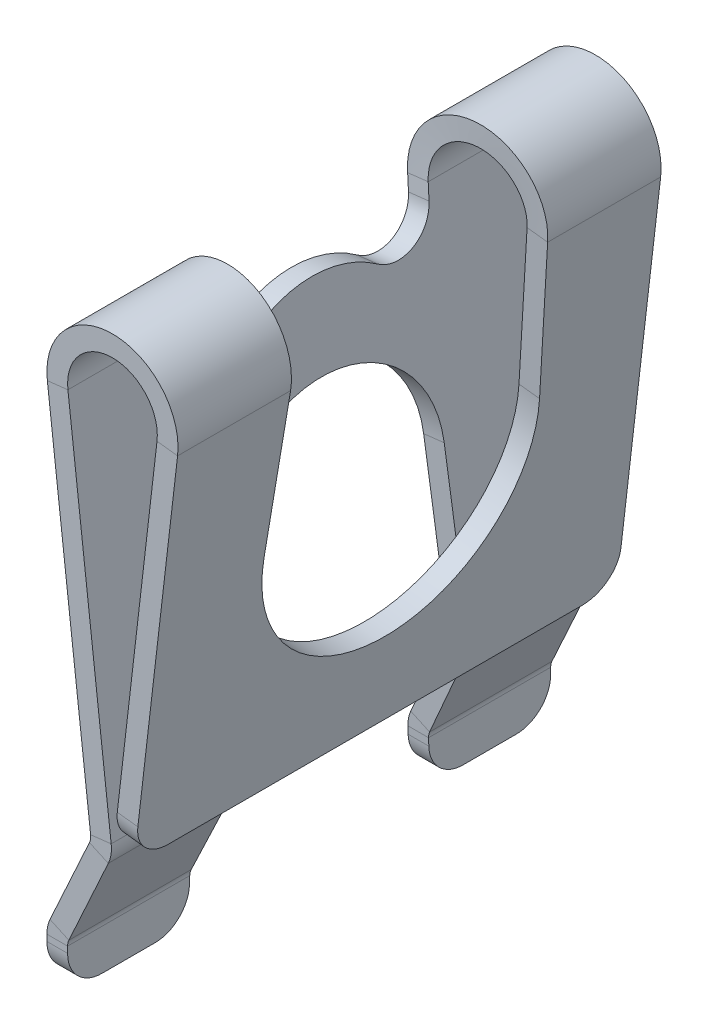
ISO-10303-21;
HEADER;
FILE_DESCRIPTION(('STEP AP214'),'2;1');
FILE_NAME('part.step','',(''),(''),'','','');
FILE_SCHEMA(('AUTOMOTIVE_DESIGN { 1 0 10303 214 1 1 1 1 }'));
ENDSEC;
DATA;
#1=APPLICATION_CONTEXT('core data for automotive mechanical design processes');
#2=APPLICATION_PROTOCOL_DEFINITION('international standard','automotive_design',2000,#1);
#3=PRODUCT_CONTEXT('',#1,'mechanical');
#4=PRODUCT('Part','Part','',(#3));
#5=PRODUCT_RELATED_PRODUCT_CATEGORY('part','',(#4));
#6=PRODUCT_DEFINITION_FORMATION('','',#4);
#7=PRODUCT_DEFINITION_CONTEXT('part definition',#1,'design');
#8=PRODUCT_DEFINITION('design','',#6,#7);
#9=PRODUCT_DEFINITION_SHAPE('','',#8);
#10=(LENGTH_UNIT() NAMED_UNIT(*) SI_UNIT(.MILLI.,.METRE.));
#11=(NAMED_UNIT(*) PLANE_ANGLE_UNIT() SI_UNIT($,.RADIAN.));
#12=(NAMED_UNIT(*) SI_UNIT($,.STERADIAN.) SOLID_ANGLE_UNIT());
#13=UNCERTAINTY_MEASURE_WITH_UNIT(LENGTH_MEASURE(1.E-05),#10,'distance_accuracy_value','');
#14=(GEOMETRIC_REPRESENTATION_CONTEXT(3) GLOBAL_UNCERTAINTY_ASSIGNED_CONTEXT((#13)) GLOBAL_UNIT_ASSIGNED_CONTEXT((#10,
#11,#12)) REPRESENTATION_CONTEXT('',''));
#15=CARTESIAN_POINT('',(0.,0.,0.));
#16=DIRECTION('',(0.,0.,1.));
#17=DIRECTION('',(1.,0.,0.));
#18=AXIS2_PLACEMENT_3D('',#15,#16,#17);
#19=CARTESIAN_POINT('',(0.462977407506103,-16.2952615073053,-26.2498190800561));
#20=DIRECTION('',(0.909474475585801,-0.415759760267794,0.));
#21=DIRECTION('',(0.415759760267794,0.909474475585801,0.));
#22=AXIS2_PLACEMENT_3D('',#19,#20,#21);
#23=PLANE('',#22);
#24=DIRECTION('',(0.,0.,1.));
#25=VECTOR('',#24,1.);
#26=CARTESIAN_POINT('',(0.288791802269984,-16.6762925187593,-26.2498190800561));
#27=LINE('',#26,#25);
#28=CARTESIAN_POINT('',(0.288791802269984,-16.6762925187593,-26.2498190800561));
#29=VERTEX_POINT('',#28);
#30=CARTESIAN_POINT('',(0.288791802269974,-16.6762925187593,-12.6117475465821));
#31=VERTEX_POINT('',#30);
#32=EDGE_CURVE('E1318',#29,#31,#27,.T.);
#33=ORIENTED_EDGE('',*,*,#32,.T.);
#34=DIRECTION('',(-0.415531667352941,-0.908975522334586,-0.0331199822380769));
#35=VECTOR('',#34,1.);
#36=CARTESIAN_POINT('',(8.0487980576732,0.298721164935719,-11.9932356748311));
#37=LINE('',#36,#35);
#38=CARTESIAN_POINT('',(-3.99755187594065,-26.0526693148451,-12.9533908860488));
#39=VERTEX_POINT('',#38);
#40=EDGE_CURVE('E1332',#31,#39,#37,.T.);
#41=ORIENTED_EDGE('',*,*,#40,.T.);
#42=DIRECTION('',(0.,0.,1.));
#43=VECTOR('',#42,1.);
#44=CARTESIAN_POINT('',(-3.99755187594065,-26.0526693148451,-26.2498190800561));
#45=LINE('',#44,#43);
#46=CARTESIAN_POINT('',(-3.99755187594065,-26.0526693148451,-26.2498190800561));
#47=VERTEX_POINT('',#46);
#48=EDGE_CURVE('E1174',#47,#39,#45,.T.);
#49=ORIENTED_EDGE('',*,*,#48,.F.);
#50=DIRECTION('',(0.415759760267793,0.909474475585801,0.));
#51=VECTOR('',#50,1.);
#52=CARTESIAN_POINT('',(0.462977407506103,-16.2952615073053,-26.2498190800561));
#53=LINE('',#52,#51);
#54=EDGE_CURVE('E1328',#47,#29,#53,.T.);
#55=ORIENTED_EDGE('',*,*,#54,.T.);
#56=EDGE_LOOP('',(#33,#41,#49,#55));
#57=FACE_BOUND('',#56,.T.);
#58=ADVANCED_FACE('F83',(#57),#23,.T.);
#59=CARTESIAN_POINT('',(-1.58334016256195,-15.3598020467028,-26.2498190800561));
#60=DIRECTION('',(0.909474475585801,-0.415759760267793,0.));
#61=DIRECTION('',(0.415759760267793,0.909474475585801,0.));
#62=AXIS2_PLACEMENT_3D('',#59,#60,#61);
#63=PLANE('',#62);
#64=DIRECTION('',(-0.415531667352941,-0.908975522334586,-0.0331199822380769));
#65=VECTOR('',#64,1.);
#66=CARTESIAN_POINT('',(6.00248048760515,1.23418062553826,-11.9932356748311));
#67=LINE('',#66,#65);
#68=CARTESIAN_POINT('',(-1.75752576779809,-15.7408330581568,-12.6117475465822));
#69=VERTEX_POINT('',#68);
#70=CARTESIAN_POINT('',(-6.0438694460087,-25.1172098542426,-12.9533908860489));
#71=VERTEX_POINT('',#70);
#72=EDGE_CURVE('E1330',#69,#71,#67,.T.);
#73=ORIENTED_EDGE('',*,*,#72,.F.);
#74=DIRECTION('',(0.,0.,1.));
#75=VECTOR('',#74,1.);
#76=CARTESIAN_POINT('',(-1.75752576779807,-15.7408330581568,-26.2498190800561));
#77=LINE('',#76,#75);
#78=CARTESIAN_POINT('',(-1.75752576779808,-15.7408330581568,-26.2498190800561));
#79=VERTEX_POINT('',#78);
#80=EDGE_CURVE('E1336',#79,#69,#77,.T.);
#81=ORIENTED_EDGE('',*,*,#80,.F.);
#82=DIRECTION('',(0.415759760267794,0.909474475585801,0.));
#83=VECTOR('',#82,1.);
#84=CARTESIAN_POINT('',(-1.58334016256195,-15.3598020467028,-26.2498190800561));
#85=LINE('',#84,#83);
#86=CARTESIAN_POINT('',(-6.04386944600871,-25.1172098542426,-26.2498190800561));
#87=VERTEX_POINT('',#86);
#88=EDGE_CURVE('E1343',#87,#79,#85,.T.);
#89=ORIENTED_EDGE('',*,*,#88,.F.);
#90=DIRECTION('',(0.,0.,1.));
#91=VECTOR('',#90,1.);
#92=CARTESIAN_POINT('',(-6.04386944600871,-25.1172098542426,-26.2498190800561));
#93=LINE('',#92,#91);
#94=EDGE_CURVE('E1185',#87,#71,#93,.T.);
#95=ORIENTED_EDGE('',*,*,#94,.T.);
#96=EDGE_LOOP('',(#73,#81,#89,#95));
#97=FACE_BOUND('',#96,.T.);
#98=ADVANCED_FACE('F1350',(#97),#63,.F.);
#99=CARTESIAN_POINT('',(0.603082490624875,-14.6833545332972,-26.2498190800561));
#100=DIRECTION('',(0.,0.,-1.));
#101=DIRECTION('',(-1.,0.,0.));
#102=AXIS2_PLACEMENT_3D('',#99,#100,#101);
#103=PLANE('',#102);
#104=ORIENTED_EDGE('',*,*,#88,.T.);
#105=DIRECTION('',(0.9094744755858,-0.415759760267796,0.));
#106=VECTOR('',#105,1.);
#107=CARTESIAN_POINT('',(-1.75752576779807,-15.7408330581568,-26.2498190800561));
#108=LINE('',#107,#106);
#109=EDGE_CURVE('E1314',#79,#29,#108,.T.);
#110=ORIENTED_EDGE('',*,*,#109,.T.);
#111=ORIENTED_EDGE('',*,*,#54,.F.);
#112=DIRECTION('',(-0.9094744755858,0.415759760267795,0.));
#113=VECTOR('',#112,1.);
#114=CARTESIAN_POINT('',(-3.99755187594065,-26.0526693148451,-26.2498190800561));
#115=LINE('',#114,#113);
#116=EDGE_CURVE('E1176',#47,#87,#115,.T.);
#117=ORIENTED_EDGE('',*,*,#116,.T.);
#118=EDGE_LOOP('',(#104,#110,#111,#117));
#119=FACE_BOUND('',#118,.T.);
#120=ADVANCED_FACE('F1472',(#119),#103,.T.);
#121=CARTESIAN_POINT('',(6.00248048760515,1.23418062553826,-11.9932356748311));
#122=DIRECTION('',(-0.0137699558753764,-0.030121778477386,0.999451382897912));
#123=DIRECTION('',(-0.415531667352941,-0.908975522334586,-0.0331199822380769));
#124=AXIS2_PLACEMENT_3D('',#121,#122,#123);
#125=PLANE('',#124);
#126=CARTESIAN_POINT('',(-1.75752576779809,-15.7408330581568,-12.6117475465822));
#127=CARTESIAN_POINT('',(0.288791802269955,-16.6762925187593,-12.6117475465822));
#128=B_SPLINE_CURVE_WITH_KNOTS('',1,(#126,#127),.UNSPECIFIED.,.F.,.F.,(2,2),(0.,1.),.UNSPECIFIED.);
#129=EDGE_CURVE('E990',#31,#69,#128,.F.);
#130=ORIENTED_EDGE('',*,*,#129,.T.);
#131=ORIENTED_EDGE('',*,*,#72,.T.);
#132=CARTESIAN_POINT('',(-3.99755187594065,-26.0526693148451,-12.9533908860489));
#133=CARTESIAN_POINT('',(-6.0438694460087,-25.1172098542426,-12.9533908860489));
#134=B_SPLINE_CURVE_WITH_KNOTS('',1,(#132,#133),.UNSPECIFIED.,.F.,.F.,(2,2),(0.,1.),.UNSPECIFIED.);
#135=EDGE_CURVE('E700',#71,#39,#134,.F.);
#136=ORIENTED_EDGE('',*,*,#135,.T.);
#137=ORIENTED_EDGE('',*,*,#40,.F.);
#138=EDGE_LOOP('',(#130,#131,#136,#137));
#139=FACE_BOUND('',#138,.T.);
#140=ADVANCED_FACE('F1107',(#139),#125,.T.);
#141=CARTESIAN_POINT('',(-7.97417020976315,58.9585510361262,-14.9713728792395));
#142=DIRECTION('',(-0.00712152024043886,0.0611433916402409,0.998103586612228));
#143=DIRECTION('',(0.115470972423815,-0.991401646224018,0.0615567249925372));
#144=AXIS2_PLACEMENT_3D('',#141,#142,#143);
#145=PLANE('',#144);
#146=DIRECTION('',(0.115470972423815,-0.991401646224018,0.0615567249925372));
#147=VECTOR('',#146,1.);
#148=CARTESIAN_POINT('',(-7.97417020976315,58.9585510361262,-14.9713728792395));
#149=LINE('',#148,#147);
#150=CARTESIAN_POINT('',(-4.1006061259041,25.7012074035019,-12.9064043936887));
#151=VERTEX_POINT('',#150);
#152=CARTESIAN_POINT('',(-3.9065082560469,24.0347370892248,-12.8029322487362));
#153=VERTEX_POINT('',#152);
#154=EDGE_CURVE('E1021',#151,#153,#149,.T.);
#155=ORIENTED_EDGE('',*,*,#154,.F.);
#156=CARTESIAN_POINT('',(-6.33549810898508,25.4409040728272,-12.9064043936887));
#157=CARTESIAN_POINT('',(-4.1006061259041,25.7012074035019,-12.9064043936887));
#158=B_SPLINE_CURVE_WITH_KNOTS('',1,(#156,#157),.UNSPECIFIED.,.F.,.F.,(2,2),(0.,1.),.UNSPECIFIED.);
#159=CARTESIAN_POINT('',(-6.33549810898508,25.4409040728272,-12.9064043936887));
#160=VERTEX_POINT('',#159);
#161=EDGE_CURVE('E480',#151,#160,#158,.F.);
#162=ORIENTED_EDGE('',*,*,#161,.T.);
#163=DIRECTION('',(0.115470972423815,-0.991401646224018,0.0615567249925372));
#164=VECTOR('',#163,1.);
#165=CARTESIAN_POINT('',(-10.2090621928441,58.6982477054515,-14.9713728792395));
#166=LINE('',#165,#164);
#167=CARTESIAN_POINT('',(-6.14140023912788,23.77443375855,-12.8029322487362));
#168=VERTEX_POINT('',#167);
#169=EDGE_CURVE('E1061',#160,#168,#166,.T.);
#170=ORIENTED_EDGE('',*,*,#169,.T.);
#171=DIRECTION('',(0.993285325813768,0.11569036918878,0.));
#172=VECTOR('',#171,1.);
#173=CARTESIAN_POINT('',(-3.9065082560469,24.0347370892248,-12.8029322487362));
#174=LINE('',#173,#172);
#175=EDGE_CURVE('E1058',#153,#168,#174,.F.);
#176=ORIENTED_EDGE('',*,*,#175,.F.);
#177=EDGE_LOOP('',(#155,#162,#170,#176));
#178=FACE_BOUND('',#177,.T.);
#179=ADVANCED_FACE('F1516',(#178),#145,.T.);
#180=CARTESIAN_POINT('',(-3.93321395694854,24.2640248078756,-9.06004379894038));
#181=DIRECTION('',(0.993285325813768,0.11569036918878,0.));
#182=DIRECTION('',(-0.11569036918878,0.993285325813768,0.));
#183=AXIS2_PLACEMENT_3D('',#180,#181,#182);
#184=CYLINDRICAL_SURFACE('',#183,3.75);
#185=DIRECTION('',(0.993285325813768,0.11569036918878,0.));
#186=VECTOR('',#185,1.);
#187=CARTESIAN_POINT('',(-3.57834416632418,21.2172115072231,-6.90284743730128));
#188=LINE('',#187,#186);
#189=CARTESIAN_POINT('',(-3.57834416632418,21.2172115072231,-6.90284743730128));
#190=VERTEX_POINT('',#189);
#191=CARTESIAN_POINT('',(-5.81323614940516,20.9569081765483,-6.90284743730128));
#192=VERTEX_POINT('',#191);
#193=EDGE_CURVE('E1053',#190,#192,#188,.F.);
#194=ORIENTED_EDGE('',*,*,#193,.F.);
#195=CARTESIAN_POINT('',(-3.93321395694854,24.2640248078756,-9.06004379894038));
#196=DIRECTION('',(0.993285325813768,0.11569036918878,0.));
#197=DIRECTION('',(-0.11569036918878,0.993285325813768,0.));
#198=AXIS2_PLACEMENT_3D('',#195,#196,#197);
#199=CIRCLE('',#198,3.75);
#200=EDGE_CURVE('E1018',#153,#190,#199,.F.);
#201=ORIENTED_EDGE('',*,*,#200,.F.);
#202=ORIENTED_EDGE('',*,*,#175,.T.);
#203=CARTESIAN_POINT('',(-6.16810594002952,24.0037214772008,-9.06004379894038));
#204=DIRECTION('',(0.993285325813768,0.11569036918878,0.));
#205=DIRECTION('',(-0.11569036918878,0.993285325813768,0.));
#206=AXIS2_PLACEMENT_3D('',#203,#204,#205);
#207=CIRCLE('',#206,3.75);
#208=EDGE_CURVE('E1056',#168,#192,#207,.F.);
#209=ORIENTED_EDGE('',*,*,#208,.T.);
#210=EDGE_LOOP('',(#194,#201,#202,#209));
#211=FACE_BOUND('',#210,.T.);
#212=ADVANCED_FACE('F1525',(#211),#184,.F.);
#213=CARTESIAN_POINT('',(-2.44276083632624,11.467408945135,0.000180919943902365));
#214=DIRECTION('',(0.993285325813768,0.11569036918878,0.));
#215=DIRECTION('',(-0.11569036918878,0.993285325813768,0.));
#216=AXIS2_PLACEMENT_3D('',#213,#214,#215);
#217=CYLINDRICAL_SURFACE('',#216,12.);
#218=DIRECTION('',(0.993285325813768,0.11569036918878,0.));
#219=VECTOR('',#218,1.);
#220=CARTESIAN_POINT('',(-3.57834416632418,21.2172115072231,6.90320927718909));
#221=LINE('',#220,#219);
#222=CARTESIAN_POINT('',(-3.57834416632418,21.2172115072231,6.90320927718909));
#223=VERTEX_POINT('',#222);
#224=CARTESIAN_POINT('',(-5.81323614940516,20.9569081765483,6.9032092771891));
#225=VERTEX_POINT('',#224);
#226=EDGE_CURVE('E1048',#223,#225,#221,.F.);
#227=ORIENTED_EDGE('',*,*,#226,.F.);
#228=CARTESIAN_POINT('',(-2.44276083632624,11.467408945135,0.000180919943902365));
#229=DIRECTION('',(0.993285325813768,0.11569036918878,0.));
#230=DIRECTION('',(-0.11569036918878,0.993285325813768,0.));
#231=AXIS2_PLACEMENT_3D('',#228,#229,#230);
#232=CIRCLE('',#231,12.);
#233=EDGE_CURVE('E1015',#190,#223,#232,.T.);
#234=ORIENTED_EDGE('',*,*,#233,.F.);
#235=ORIENTED_EDGE('',*,*,#193,.T.);
#236=CARTESIAN_POINT('',(-4.67765281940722,11.2071056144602,0.000180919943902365));
#237=DIRECTION('',(0.993285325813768,0.11569036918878,0.));
#238=DIRECTION('',(-0.11569036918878,0.993285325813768,0.));
#239=AXIS2_PLACEMENT_3D('',#236,#237,#238);
#240=CIRCLE('',#239,12.);
#241=EDGE_CURVE('E1051',#192,#225,#240,.T.);
#242=ORIENTED_EDGE('',*,*,#241,.T.);
#243=EDGE_LOOP('',(#227,#234,#235,#242));
#244=FACE_BOUND('',#243,.T.);
#245=ADVANCED_FACE('F1528',(#244),#217,.T.);
#246=CARTESIAN_POINT('',(-3.93321395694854,24.2640248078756,9.06040563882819));
#247=DIRECTION('',(0.993285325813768,0.11569036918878,0.));
#248=DIRECTION('',(-0.11569036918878,0.993285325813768,0.));
#249=AXIS2_PLACEMENT_3D('',#246,#247,#248);
#250=CYLINDRICAL_SURFACE('',#249,3.75000000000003);
#251=DIRECTION('',(0.993285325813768,0.11569036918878,0.));
#252=VECTOR('',#251,1.);
#253=CARTESIAN_POINT('',(-3.9065082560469,24.0347370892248,12.8032940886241));
#254=LINE('',#253,#252);
#255=CARTESIAN_POINT('',(-3.9065082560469,24.0347370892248,12.8032940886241));
#256=VERTEX_POINT('',#255);
#257=CARTESIAN_POINT('',(-6.14140023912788,23.77443375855,12.8032940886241));
#258=VERTEX_POINT('',#257);
#259=EDGE_CURVE('E1043',#256,#258,#254,.F.);
#260=ORIENTED_EDGE('',*,*,#259,.F.);
#261=CARTESIAN_POINT('',(-3.93321395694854,24.2640248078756,9.06040563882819));
#262=DIRECTION('',(0.993285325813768,0.11569036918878,0.));
#263=DIRECTION('',(-0.11569036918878,0.993285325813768,0.));
#264=AXIS2_PLACEMENT_3D('',#261,#262,#263);
#265=CIRCLE('',#264,3.75000000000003);
#266=EDGE_CURVE('E1011',#223,#256,#265,.F.);
#267=ORIENTED_EDGE('',*,*,#266,.F.);
#268=ORIENTED_EDGE('',*,*,#226,.T.);
#269=CARTESIAN_POINT('',(-6.16810594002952,24.0037214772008,9.06040563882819));
#270=DIRECTION('',(0.993285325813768,0.11569036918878,0.));
#271=DIRECTION('',(-0.11569036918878,0.993285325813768,0.));
#272=AXIS2_PLACEMENT_3D('',#269,#270,#271);
#273=CIRCLE('',#272,3.75000000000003);
#274=EDGE_CURVE('E1046',#225,#258,#273,.F.);
#275=ORIENTED_EDGE('',*,*,#274,.T.);
#276=EDGE_LOOP('',(#260,#267,#268,#275));
#277=FACE_BOUND('',#276,.T.);
#278=ADVANCED_FACE('F1532',(#277),#250,.F.);
#279=CARTESIAN_POINT('',(-7.97417020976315,58.9585510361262,14.9717347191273));
#280=DIRECTION('',(-0.00712152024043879,0.0611433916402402,-0.998103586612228));
#281=DIRECTION('',(-0.115470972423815,0.991401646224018,0.0615567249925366));
#282=AXIS2_PLACEMENT_3D('',#279,#280,#281);
#283=PLANE('',#282);
#284=CARTESIAN_POINT('',(-4.1006061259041,25.7012074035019,12.9067662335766));
#285=CARTESIAN_POINT('',(-6.33549810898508,25.4409040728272,12.9067662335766));
#286=B_SPLINE_CURVE_WITH_KNOTS('',1,(#284,#285),.UNSPECIFIED.,.F.,.F.,(2,2),(0.,1.),.UNSPECIFIED.);
#287=CARTESIAN_POINT('',(-4.1006061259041,25.7012074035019,12.9067662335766));
#288=VERTEX_POINT('',#287);
#289=CARTESIAN_POINT('',(-6.33549810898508,25.4409040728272,12.9067662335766));
#290=VERTEX_POINT('',#289);
#291=EDGE_CURVE('E558',#288,#290,#286,.T.);
#292=ORIENTED_EDGE('',*,*,#291,.F.);
#293=DIRECTION('',(-0.115470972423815,0.991401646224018,0.0615567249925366));
#294=VECTOR('',#293,1.);
#295=CARTESIAN_POINT('',(-7.97417020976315,58.9585510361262,14.9717347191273));
#296=LINE('',#295,#294);
#297=EDGE_CURVE('E1014',#256,#288,#296,.T.);
#298=ORIENTED_EDGE('',*,*,#297,.F.);
#299=ORIENTED_EDGE('',*,*,#259,.T.);
#300=DIRECTION('',(-0.115470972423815,0.991401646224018,0.0615567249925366));
#301=VECTOR('',#300,1.);
#302=CARTESIAN_POINT('',(-10.2090621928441,58.6982477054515,14.9717347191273));
#303=LINE('',#302,#301);
#304=EDGE_CURVE('E1042',#258,#290,#303,.T.);
#305=ORIENTED_EDGE('',*,*,#304,.T.);
#306=EDGE_LOOP('',(#292,#298,#299,#305));
#307=FACE_BOUND('',#306,.T.);
#308=ADVANCED_FACE('F1536',(#307),#283,.T.);
#309=CARTESIAN_POINT('',(-1.40154751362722,2.52784101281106,0.000180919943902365));
#310=DIRECTION('',(0.993285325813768,0.11569036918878,0.));
#311=DIRECTION('',(-0.11569036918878,0.993285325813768,0.));
#312=AXIS2_PLACEMENT_3D('',#309,#310,#311);
#313=CYLINDRICAL_SURFACE('',#312,12.);
#314=DIRECTION('',(0.993285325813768,0.11569036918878,0.));
#315=VECTOR('',#314,1.);
#316=CARTESIAN_POINT('',(-1.447527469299,2.92261212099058,-11.9932356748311));
#317=LINE('',#316,#315);
#318=CARTESIAN_POINT('',(-1.447527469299,2.92261212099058,-11.9932356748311));
#319=VERTEX_POINT('',#318);
#320=CARTESIAN_POINT('',(-3.68241945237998,2.66230879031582,-11.993235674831));
#321=VERTEX_POINT('',#320);
#322=EDGE_CURVE('E1030',#319,#321,#317,.F.);
#323=ORIENTED_EDGE('',*,*,#322,.F.);
#324=CARTESIAN_POINT('',(-1.40154751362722,2.52784101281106,0.000180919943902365));
#325=DIRECTION('',(0.993285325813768,0.11569036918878,0.));
#326=DIRECTION('',(-0.11569036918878,0.993285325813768,0.));
#327=AXIS2_PLACEMENT_3D('',#324,#325,#326);
#328=CIRCLE('',#327,12.);
#329=CARTESIAN_POINT('',(-1.447527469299,2.9226121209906,11.9935975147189));
#330=VERTEX_POINT('',#329);
#331=EDGE_CURVE('E1026',#330,#319,#328,.F.);
#332=ORIENTED_EDGE('',*,*,#331,.F.);
#333=DIRECTION('',(0.993285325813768,0.11569036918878,0.));
#334=VECTOR('',#333,1.);
#335=CARTESIAN_POINT('',(-1.447527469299,2.9226121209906,11.9935975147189));
#336=LINE('',#335,#334);
#337=CARTESIAN_POINT('',(-3.68241945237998,2.66230879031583,11.9935975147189));
#338=VERTEX_POINT('',#337);
#339=EDGE_CURVE('E1039',#330,#338,#336,.F.);
#340=ORIENTED_EDGE('',*,*,#339,.T.);
#341=CARTESIAN_POINT('',(-3.63643949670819,2.26753768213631,0.000180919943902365));
#342=DIRECTION('',(0.993285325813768,0.11569036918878,0.));
#343=DIRECTION('',(-0.11569036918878,0.993285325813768,0.));
#344=AXIS2_PLACEMENT_3D('',#341,#342,#343);
#345=CIRCLE('',#344,12.);
#346=EDGE_CURVE('E1037',#338,#321,#345,.F.);
#347=ORIENTED_EDGE('',*,*,#346,.T.);
#348=EDGE_LOOP('',(#323,#332,#340,#347));
#349=FACE_BOUND('',#348,.T.);
#350=ADVANCED_FACE('F1540',(#349),#313,.F.);
#351=CARTESIAN_POINT('',(-6.33549810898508,25.4409040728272,-26.2498190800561));
#352=DIRECTION('',(0.993285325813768,0.11569036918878,0.));
#353=DIRECTION('',(-0.115690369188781,0.993285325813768,0.));
#354=AXIS2_PLACEMENT_3D('',#351,#352,#353);
#355=PLANE('',#354);
#356=DIRECTION('',(0.115626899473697,-0.992740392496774,-0.0331199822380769));
#357=VECTOR('',#356,1.);
#358=CARTESIAN_POINT('',(-3.68241945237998,2.66230879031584,-11.9932356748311));
#359=LINE('',#358,#357);
#360=CARTESIAN_POINT('',(-1.63180949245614,-14.943657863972,-12.5806090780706));
#361=VERTEX_POINT('',#360);
#362=EDGE_CURVE('E1029',#321,#361,#359,.T.);
#363=ORIENTED_EDGE('',*,*,#362,.F.);
#364=ORIENTED_EDGE('',*,*,#346,.F.);
#365=DIRECTION('',(-0.115626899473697,0.992740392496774,-0.0331199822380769));
#366=VECTOR('',#365,1.);
#367=CARTESIAN_POINT('',(-3.68241945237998,2.66230879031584,11.9935975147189));
#368=LINE('',#367,#366);
#369=CARTESIAN_POINT('',(-1.63180949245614,-14.943657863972,12.5809709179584));
#370=VERTEX_POINT('',#369);
#371=EDGE_CURVE('E1333',#370,#338,#368,.T.);
#372=ORIENTED_EDGE('',*,*,#371,.F.);
#373=DIRECTION('',(0.,0.,1.));
#374=VECTOR('',#373,1.);
#375=CARTESIAN_POINT('',(-1.63180949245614,-14.9436578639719,-26.2498190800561));
#376=LINE('',#375,#374);
#377=CARTESIAN_POINT('',(-1.63180949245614,-14.9436578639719,26.2501809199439));
#378=VERTEX_POINT('',#377);
#379=EDGE_CURVE('E1036',#370,#378,#376,.T.);
#380=ORIENTED_EDGE('',*,*,#379,.T.);
#381=DIRECTION('',(-0.115690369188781,0.993285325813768,0.));
#382=VECTOR('',#381,1.);
#383=CARTESIAN_POINT('',(-6.33549810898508,25.4409040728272,26.2501809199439));
#384=LINE('',#383,#382);
#385=CARTESIAN_POINT('',(-6.33549810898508,25.4409040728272,26.2501809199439));
#386=VERTEX_POINT('',#385);
#387=EDGE_CURVE('E1034',#378,#386,#384,.T.);
#388=ORIENTED_EDGE('',*,*,#387,.T.);
#389=DIRECTION('',(0.,0.,1.));
#390=VECTOR('',#389,1.);
#391=CARTESIAN_POINT('',(-6.33549810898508,25.4409040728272,-26.2498190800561));
#392=LINE('',#391,#390);
#393=EDGE_CURVE('E1378',#290,#386,#392,.T.);
#394=ORIENTED_EDGE('',*,*,#393,.F.);
#395=ORIENTED_EDGE('',*,*,#304,.F.);
#396=ORIENTED_EDGE('',*,*,#274,.F.);
#397=ORIENTED_EDGE('',*,*,#241,.F.);
#398=ORIENTED_EDGE('',*,*,#208,.F.);
#399=ORIENTED_EDGE('',*,*,#169,.F.);
#400=DIRECTION('',(0.,0.,1.));
#401=VECTOR('',#400,1.);
#402=CARTESIAN_POINT('',(-6.33549810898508,25.4409040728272,-26.2498190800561));
#403=LINE('',#402,#401);
#404=CARTESIAN_POINT('',(-6.33549810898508,25.4409040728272,-26.2498190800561));
#405=VERTEX_POINT('',#404);
#406=EDGE_CURVE('E1496',#405,#160,#403,.T.);
#407=ORIENTED_EDGE('',*,*,#406,.F.);
#408=DIRECTION('',(-0.115690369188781,0.993285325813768,0.));
#409=VECTOR('',#408,1.);
#410=CARTESIAN_POINT('',(-6.33549810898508,25.4409040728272,-26.2498190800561));
#411=LINE('',#410,#409);
#412=CARTESIAN_POINT('',(-1.63180949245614,-14.9436578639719,-26.2498190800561));
#413=VERTEX_POINT('',#412);
#414=EDGE_CURVE('E1007',#413,#405,#411,.T.);
#415=ORIENTED_EDGE('',*,*,#414,.F.);
#416=DIRECTION('',(0.,0.,1.));
#417=VECTOR('',#416,1.);
#418=CARTESIAN_POINT('',(-1.63180949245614,-14.9436578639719,-26.2498190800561));
#419=LINE('',#418,#417);
#420=EDGE_CURVE('E1033',#413,#361,#419,.T.);
#421=ORIENTED_EDGE('',*,*,#420,.T.);
#422=EDGE_LOOP('',(#363,#364,#372,#380,#388,#394,#395,#396,#397,#398,#399,#407,#415,#421));
#423=FACE_BOUND('',#422,.T.);
#424=ADVANCED_FACE('F1089',(#423),#355,.F.);
#425=CARTESIAN_POINT('',(-1.447527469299,2.9226121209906,-11.9932356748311));
#426=DIRECTION('',(0.00383166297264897,-0.0328975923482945,0.999451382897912));
#427=DIRECTION('',(0.115626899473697,-0.992740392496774,-0.0331199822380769));
#428=AXIS2_PLACEMENT_3D('',#425,#426,#427);
#429=PLANE('',#428);
#430=CARTESIAN_POINT('',(0.603082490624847,-14.6833545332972,-12.5806090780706));
#431=CARTESIAN_POINT('',(-1.63180949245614,-14.943657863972,-12.5806090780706));
#432=B_SPLINE_CURVE_WITH_KNOTS('',1,(#430,#431),.UNSPECIFIED.,.F.,.F.,(2,2),(0.,1.),.UNSPECIFIED.);
#433=CARTESIAN_POINT('',(0.603082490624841,-14.6833545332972,-12.5806090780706));
#434=VERTEX_POINT('',#433);
#435=EDGE_CURVE('E980',#434,#361,#432,.T.);
#436=ORIENTED_EDGE('',*,*,#435,.F.);
#437=DIRECTION('',(0.115626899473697,-0.992740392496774,-0.0331199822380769));
#438=VECTOR('',#437,1.);
#439=CARTESIAN_POINT('',(-1.447527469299,2.9226121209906,-11.9932356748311));
#440=LINE('',#439,#438);
#441=EDGE_CURVE('E1025',#319,#434,#440,.T.);
#442=ORIENTED_EDGE('',*,*,#441,.F.);
#443=ORIENTED_EDGE('',*,*,#322,.T.);
#444=ORIENTED_EDGE('',*,*,#362,.T.);
#445=EDGE_LOOP('',(#436,#442,#443,#444));
#446=FACE_BOUND('',#445,.T.);
#447=ADVANCED_FACE('F1078',(#446),#429,.T.);
#448=CARTESIAN_POINT('',(-4.1006061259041,25.7012074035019,-26.2498190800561));
#449=DIRECTION('',(0.993285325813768,0.11569036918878,0.));
#450=DIRECTION('',(-0.11569036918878,0.993285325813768,0.));
#451=AXIS2_PLACEMENT_3D('',#448,#449,#450);
#452=PLANE('',#451);
#453=ORIENTED_EDGE('',*,*,#331,.T.);
#454=ORIENTED_EDGE('',*,*,#441,.T.);
#455=DIRECTION('',(0.,0.,1.));
#456=VECTOR('',#455,1.);
#457=CARTESIAN_POINT('',(0.603082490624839,-14.6833545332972,-26.2498190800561));
#458=LINE('',#457,#456);
#459=CARTESIAN_POINT('',(0.603082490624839,-14.6833545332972,-26.2498190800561));
#460=VERTEX_POINT('',#459);
#461=EDGE_CURVE('E1076',#460,#434,#458,.T.);
#462=ORIENTED_EDGE('',*,*,#461,.F.);
#463=DIRECTION('',(-0.11569036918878,0.993285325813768,0.));
#464=VECTOR('',#463,1.);
#465=CARTESIAN_POINT('',(-4.1006061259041,25.7012074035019,-26.2498190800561));
#466=LINE('',#465,#464);
#467=CARTESIAN_POINT('',(-4.1006061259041,25.7012074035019,-26.2498190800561));
#468=VERTEX_POINT('',#467);
#469=EDGE_CURVE('E1022',#460,#468,#466,.T.);
#470=ORIENTED_EDGE('',*,*,#469,.T.);
#471=DIRECTION('',(0.,0.,1.));
#472=VECTOR('',#471,1.);
#473=CARTESIAN_POINT('',(-4.1006061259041,25.7012074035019,-26.2498190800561));
#474=LINE('',#473,#472);
#475=EDGE_CURVE('E1498',#468,#151,#474,.T.);
#476=ORIENTED_EDGE('',*,*,#475,.T.);
#477=ORIENTED_EDGE('',*,*,#154,.T.);
#478=ORIENTED_EDGE('',*,*,#200,.T.);
#479=ORIENTED_EDGE('',*,*,#233,.T.);
#480=ORIENTED_EDGE('',*,*,#266,.T.);
#481=ORIENTED_EDGE('',*,*,#297,.T.);
#482=DIRECTION('',(0.,0.,1.));
#483=VECTOR('',#482,1.);
#484=CARTESIAN_POINT('',(-4.1006061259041,25.7012074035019,-26.2498190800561));
#485=LINE('',#484,#483);
#486=CARTESIAN_POINT('',(-4.1006061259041,25.7012074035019,26.2501809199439));
#487=VERTEX_POINT('',#486);
#488=EDGE_CURVE('E1393',#288,#487,#485,.T.);
#489=ORIENTED_EDGE('',*,*,#488,.T.);
#490=DIRECTION('',(-0.11569036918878,0.993285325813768,0.));
#491=VECTOR('',#490,1.);
#492=CARTESIAN_POINT('',(-4.1006061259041,25.7012074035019,26.2501809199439));
#493=LINE('',#492,#491);
#494=CARTESIAN_POINT('',(0.603082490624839,-14.6833545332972,26.2501809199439));
#495=VERTEX_POINT('',#494);
#496=EDGE_CURVE('E994',#495,#487,#493,.T.);
#497=ORIENTED_EDGE('',*,*,#496,.F.);
#498=DIRECTION('',(0.,0.,1.));
#499=VECTOR('',#498,1.);
#500=CARTESIAN_POINT('',(0.603082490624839,-14.6833545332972,-26.2498190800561));
#501=LINE('',#500,#499);
#502=CARTESIAN_POINT('',(0.603082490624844,-14.6833545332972,12.5809709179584));
#503=VERTEX_POINT('',#502);
#504=EDGE_CURVE('E913',#503,#495,#501,.T.);
#505=ORIENTED_EDGE('',*,*,#504,.F.);
#506=DIRECTION('',(-0.115626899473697,0.992740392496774,-0.0331199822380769));
#507=VECTOR('',#506,1.);
#508=CARTESIAN_POINT('',(-1.447527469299,2.9226121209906,11.9935975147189));
#509=LINE('',#508,#507);
#510=EDGE_CURVE('E1010',#503,#330,#509,.T.);
#511=ORIENTED_EDGE('',*,*,#510,.T.);
#512=EDGE_LOOP('',(#453,#454,#462,#470,#476,#477,#478,#479,#480,#481,#489,#497,#505,#511));
#513=FACE_BOUND('',#512,.T.);
#514=ADVANCED_FACE('F1088',(#513),#452,.T.);
#515=CARTESIAN_POINT('',(5.58392580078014,25.7012074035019,-26.2498190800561));
#516=DIRECTION('',(0.,0.,-1.));
#517=DIRECTION('',(-1.,0.,0.));
#518=AXIS2_PLACEMENT_3D('',#515,#516,#517);
#519=PLANE('',#518);
#520=ORIENTED_EDGE('',*,*,#414,.T.);
#521=DIRECTION('',(0.993285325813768,0.11569036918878,0.));
#522=VECTOR('',#521,1.);
#523=CARTESIAN_POINT('',(-6.33549810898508,25.4409040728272,-26.2498190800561));
#524=LINE('',#523,#522);
#525=EDGE_CURVE('E1220',#405,#468,#524,.T.);
#526=ORIENTED_EDGE('',*,*,#525,.T.);
#527=ORIENTED_EDGE('',*,*,#469,.F.);
#528=DIRECTION('',(-0.993285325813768,-0.115690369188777,0.));
#529=VECTOR('',#528,1.);
#530=CARTESIAN_POINT('',(0.603082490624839,-14.6833545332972,-26.2498190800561));
#531=LINE('',#530,#529);
#532=EDGE_CURVE('E1004',#460,#413,#531,.T.);
#533=ORIENTED_EDGE('',*,*,#532,.T.);
#534=EDGE_LOOP('',(#520,#526,#527,#533));
#535=FACE_BOUND('',#534,.T.);
#536=ADVANCED_FACE('F1093',(#535),#519,.T.);
#537=CARTESIAN_POINT('',(0.288791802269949,-16.6762925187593,26.2501809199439));
#538=DIRECTION('',(0.,0.,1.));
#539=DIRECTION('',(1.,0.,0.));
#540=AXIS2_PLACEMENT_3D('',#537,#538,#539);
#541=PLANE('',#540);
#542=ORIENTED_EDGE('',*,*,#387,.F.);
#543=DIRECTION('',(0.993285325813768,0.115690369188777,0.));
#544=VECTOR('',#543,1.);
#545=CARTESIAN_POINT('',(-1.63180949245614,-14.9436578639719,26.2501809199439));
#546=LINE('',#545,#544);
#547=EDGE_CURVE('E1001',#378,#495,#546,.T.);
#548=ORIENTED_EDGE('',*,*,#547,.T.);
#549=ORIENTED_EDGE('',*,*,#496,.T.);
#550=DIRECTION('',(-0.993285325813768,-0.11569036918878,0.));
#551=VECTOR('',#550,1.);
#552=CARTESIAN_POINT('',(-4.1006061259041,25.7012074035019,26.2501809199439));
#553=LINE('',#552,#551);
#554=EDGE_CURVE('E1254',#487,#386,#553,.T.);
#555=ORIENTED_EDGE('',*,*,#554,.T.);
#556=EDGE_LOOP('',(#542,#548,#549,#555));
#557=FACE_BOUND('',#556,.T.);
#558=ADVANCED_FACE('F1097',(#557),#541,.T.);
#559=CARTESIAN_POINT('',(-1.447527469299,2.9226121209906,11.9935975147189));
#560=DIRECTION('',(0.00383166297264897,-0.0328975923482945,-0.999451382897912));
#561=DIRECTION('',(-0.115626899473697,0.992740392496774,-0.0331199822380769));
#562=AXIS2_PLACEMENT_3D('',#559,#560,#561);
#563=PLANE('',#562);
#564=ORIENTED_EDGE('',*,*,#510,.F.);
#565=CARTESIAN_POINT('',(-1.63180949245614,-14.943657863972,12.5809709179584));
#566=CARTESIAN_POINT('',(0.603082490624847,-14.6833545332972,12.5809709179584));
#567=B_SPLINE_CURVE_WITH_KNOTS('',1,(#565,#566),.UNSPECIFIED.,.F.,.F.,(2,2),(0.,1.),.UNSPECIFIED.);
#568=EDGE_CURVE('E901',#503,#370,#567,.F.);
#569=ORIENTED_EDGE('',*,*,#568,.T.);
#570=ORIENTED_EDGE('',*,*,#371,.T.);
#571=ORIENTED_EDGE('',*,*,#339,.F.);
#572=EDGE_LOOP('',(#564,#569,#570,#571));
#573=FACE_BOUND('',#572,.T.);
#574=ADVANCED_FACE('F1101',(#573),#563,.T.);
#575=CARTESIAN_POINT('',(0.288791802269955,-16.6762925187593,-12.6117475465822));
#576=CARTESIAN_POINT('',(0.572410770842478,-16.055876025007,-12.6013488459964));
#577=CARTESIAN_POINT('',(0.682003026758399,-15.3609443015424,-12.5910077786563));
#578=CARTESIAN_POINT('',(0.603082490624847,-14.6833545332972,-12.5806090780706));
#579=CARTESIAN_POINT('',(-1.75752576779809,-15.7408330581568,-12.6117475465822));
#580=CARTESIAN_POINT('',(-1.64407835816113,-15.492666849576,-12.601348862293));
#581=CARTESIAN_POINT('',(-1.60024132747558,-15.2146933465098,-12.5910077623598));
#582=CARTESIAN_POINT('',(-1.63180949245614,-14.943657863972,-12.5806090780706));
#583=B_SPLINE_SURFACE_WITH_KNOTS('',1,3,((#575,#576,#577,#578),(#579,#580,#581,#582)),
.UNSPECIFIED.,.F.,.F.,.F.,(2,2),(4,4),(0.,1.),(0.,1.),.UNSPECIFIED.);
#584=CARTESIAN_POINT('',(0.288791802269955,-16.6762925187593,-12.6117475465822));
#585=CARTESIAN_POINT('',(0.572410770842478,-16.055876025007,-12.6013488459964));
#586=CARTESIAN_POINT('',(0.682003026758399,-15.3609443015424,-12.5910077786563));
#587=CARTESIAN_POINT('',(0.603082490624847,-14.6833545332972,-12.5806090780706));
#588=B_SPLINE_CURVE_WITH_KNOTS('',3,(#584,#585,#586,#587),.UNSPECIFIED.,.F.,.F.,(4,4),(0.,1.),.UNSPECIFIED.);
#589=EDGE_CURVE('E821',#31,#434,#588,.T.);
#590=CARTESIAN_POINT('',(-1.63180949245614,-14.943657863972,-12.5806090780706));
#591=CARTESIAN_POINT('',(-1.60024132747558,-15.2146933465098,-12.5910077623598));
#592=CARTESIAN_POINT('',(-1.64407835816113,-15.492666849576,-12.601348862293));
#593=CARTESIAN_POINT('',(-1.75752576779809,-15.7408330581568,-12.6117475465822));
#594=B_SPLINE_CURVE_WITH_KNOTS('',3,(#590,#591,#592,#593),.UNSPECIFIED.,.F.,.F.,(4,4),(0.,1.),.UNSPECIFIED.);
#595=EDGE_CURVE('E914',#69,#361,#594,.F.);
#596=ORIENTED_EDGE('',*,*,#129,.F.);
#597=ORIENTED_EDGE('',*,*,#589,.T.);
#598=ORIENTED_EDGE('',*,*,#435,.T.);
#599=ORIENTED_EDGE('',*,*,#595,.F.);
#600=EDGE_LOOP('',(#596,#597,#598,#599));
#601=FACE_BOUND('',#600,.T.);
#602=ADVANCED_FACE('F940',(#601),#583,.F.);
#603=CARTESIAN_POINT('',(-3.12173748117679,-15.1171934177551,-26.2498190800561));
#604=DIRECTION('',(0.,0.,1.));
#605=DIRECTION('',(1.,0.,0.));
#606=AXIS2_PLACEMENT_3D('',#603,#604,#605);
#607=PLANE('',#606);
#608=CARTESIAN_POINT('',(-3.12173748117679,-15.1171934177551,-26.2498190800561));
#609=DIRECTION('',(0.,0.,1.));
#610=DIRECTION('',(1.,0.,0.));
#611=AXIS2_PLACEMENT_3D('',#608,#609,#610);
#612=CIRCLE('',#611,3.75);
#613=EDGE_CURVE('E915',#460,#29,#612,.F.);
#614=ORIENTED_EDGE('',*,*,#613,.T.);
#615=ORIENTED_EDGE('',*,*,#109,.F.);
#616=CARTESIAN_POINT('',(-3.12173748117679,-15.1171934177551,-26.2498190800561));
#617=DIRECTION('',(0.,0.,-1.));
#618=DIRECTION('',(-1.,0.,0.));
#619=AXIS2_PLACEMENT_3D('',#616,#617,#618);
#620=CIRCLE('',#619,1.5);
#621=EDGE_CURVE('E905',#413,#79,#620,.T.);
#622=ORIENTED_EDGE('',*,*,#621,.F.);
#623=ORIENTED_EDGE('',*,*,#532,.F.);
#624=EDGE_LOOP('',(#614,#615,#622,#623));
#625=FACE_BOUND('',#624,.T.);
#626=ADVANCED_FACE('F934',(#625),#607,.F.);
#627=CARTESIAN_POINT('',(-3.12173748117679,-15.1171934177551,-33.3351482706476));
#628=DIRECTION('',(0.,0.,1.));
#629=DIRECTION('',(1.,0.,0.));
#630=AXIS2_PLACEMENT_3D('',#627,#628,#629);
#631=CYLINDRICAL_SURFACE('',#630,1.5);
#632=ORIENTED_EDGE('',*,*,#420,.F.);
#633=ORIENTED_EDGE('',*,*,#621,.T.);
#634=ORIENTED_EDGE('',*,*,#80,.T.);
#635=ORIENTED_EDGE('',*,*,#595,.T.);
#636=EDGE_LOOP('',(#632,#633,#634,#635));
#637=FACE_BOUND('',#636,.T.);
#638=ADVANCED_FACE('F924',(#637),#631,.F.);
#639=CARTESIAN_POINT('',(-3.12173748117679,-15.1171934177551,-33.3351482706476));
#640=DIRECTION('',(0.,0.,1.));
#641=DIRECTION('',(1.,0.,0.));
#642=AXIS2_PLACEMENT_3D('',#639,#640,#641);
#643=CYLINDRICAL_SURFACE('',#642,3.75);
#644=ORIENTED_EDGE('',*,*,#461,.T.);
#645=ORIENTED_EDGE('',*,*,#589,.F.);
#646=ORIENTED_EDGE('',*,*,#32,.F.);
#647=ORIENTED_EDGE('',*,*,#613,.F.);
#648=EDGE_LOOP('',(#644,#645,#646,#647));
#649=FACE_BOUND('',#648,.T.);
#650=ADVANCED_FACE('F933',(#649),#643,.T.);
#651=CARTESIAN_POINT('',(0.603082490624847,-14.6833545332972,12.5809709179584));
#652=CARTESIAN_POINT('',(0.682003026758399,-15.3609443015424,12.5913696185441));
#653=CARTESIAN_POINT('',(0.572410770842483,-16.0558760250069,12.6017106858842));
#654=CARTESIAN_POINT('',(0.288791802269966,-16.6762925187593,12.6121093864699));
#655=CARTESIAN_POINT('',(-1.63180949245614,-14.943657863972,12.5809709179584));
#656=CARTESIAN_POINT('',(-1.60024132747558,-15.2146933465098,12.5913696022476));
#657=CARTESIAN_POINT('',(-1.64407835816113,-15.4926668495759,12.6017107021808));
#658=CARTESIAN_POINT('',(-1.75752576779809,-15.7408330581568,12.6121093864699));
#659=B_SPLINE_SURFACE_WITH_KNOTS('',1,3,((#651,#652,#653,#654),(#655,#656,#657,#658)),
.UNSPECIFIED.,.F.,.F.,.F.,(2,2),(4,4),(0.,1.),(0.,1.),.UNSPECIFIED.);
#660=CARTESIAN_POINT('',(0.603082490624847,-14.6833545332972,12.5809709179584));
#661=CARTESIAN_POINT('',(0.682003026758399,-15.3609443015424,12.5913696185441));
#662=CARTESIAN_POINT('',(0.572410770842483,-16.0558760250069,12.6017106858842));
#663=CARTESIAN_POINT('',(0.288791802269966,-16.6762925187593,12.6121093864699));
#664=B_SPLINE_CURVE_WITH_KNOTS('',3,(#660,#661,#662,#663),.UNSPECIFIED.,.F.,.F.,(4,4),(0.,1.),.UNSPECIFIED.);
#665=CARTESIAN_POINT('',(0.288791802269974,-16.6762925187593,12.61210938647));
#666=VERTEX_POINT('',#665);
#667=EDGE_CURVE('E809',#503,#666,#664,.T.);
#668=CARTESIAN_POINT('',(0.288791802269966,-16.6762925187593,12.6121093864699));
#669=CARTESIAN_POINT('',(-1.75752576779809,-15.7408330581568,12.6121093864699));
#670=B_SPLINE_CURVE_WITH_KNOTS('',1,(#668,#669),.UNSPECIFIED.,.F.,.F.,(2,2),(0.,1.),.UNSPECIFIED.);
#671=CARTESIAN_POINT('',(-1.75752576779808,-15.7408330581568,12.6121093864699));
#672=VERTEX_POINT('',#671);
#673=EDGE_CURVE('E817',#666,#672,#670,.T.);
#674=CARTESIAN_POINT('',(-1.75752576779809,-15.7408330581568,12.6121093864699));
#675=CARTESIAN_POINT('',(-1.64407835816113,-15.4926668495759,12.6017107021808));
#676=CARTESIAN_POINT('',(-1.60024132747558,-15.2146933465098,12.5913696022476));
#677=CARTESIAN_POINT('',(-1.63180949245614,-14.943657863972,12.5809709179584));
#678=B_SPLINE_CURVE_WITH_KNOTS('',3,(#674,#675,#676,#677),.UNSPECIFIED.,.F.,.F.,(4,4),(0.,1.),.UNSPECIFIED.);
#679=EDGE_CURVE('E822',#370,#672,#678,.F.);
#680=ORIENTED_EDGE('',*,*,#568,.F.);
#681=ORIENTED_EDGE('',*,*,#667,.T.);
#682=ORIENTED_EDGE('',*,*,#673,.T.);
#683=ORIENTED_EDGE('',*,*,#679,.F.);
#684=EDGE_LOOP('',(#680,#681,#682,#683));
#685=FACE_BOUND('',#684,.T.);
#686=ADVANCED_FACE('F851',(#685),#659,.F.);
#687=CARTESIAN_POINT('',(-3.12173748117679,-15.1171934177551,26.2501809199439));
#688=DIRECTION('',(0.,0.,-1.));
#689=DIRECTION('',(-1.,0.,0.));
#690=AXIS2_PLACEMENT_3D('',#687,#688,#689);
#691=PLANE('',#690);
#692=CARTESIAN_POINT('',(-3.12173748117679,-15.1171934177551,26.2501809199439));
#693=DIRECTION('',(0.,0.,1.));
#694=DIRECTION('',(1.,0.,0.));
#695=AXIS2_PLACEMENT_3D('',#692,#693,#694);
#696=CIRCLE('',#695,3.75);
#697=CARTESIAN_POINT('',(0.288791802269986,-16.6762925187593,26.2501809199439));
#698=VERTEX_POINT('',#697);
#699=EDGE_CURVE('E823',#698,#495,#696,.T.);
#700=ORIENTED_EDGE('',*,*,#699,.T.);
#701=ORIENTED_EDGE('',*,*,#547,.F.);
#702=CARTESIAN_POINT('',(-3.12173748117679,-15.1171934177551,26.2501809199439));
#703=DIRECTION('',(0.,0.,1.));
#704=DIRECTION('',(1.,0.,0.));
#705=AXIS2_PLACEMENT_3D('',#702,#703,#704);
#706=CIRCLE('',#705,1.5);
#707=CARTESIAN_POINT('',(-1.75752576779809,-15.7408330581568,26.2501809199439));
#708=VERTEX_POINT('',#707);
#709=EDGE_CURVE('E818',#708,#378,#706,.T.);
#710=ORIENTED_EDGE('',*,*,#709,.F.);
#711=DIRECTION('',(-0.9094744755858,0.415759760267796,0.));
#712=VECTOR('',#711,1.);
#713=CARTESIAN_POINT('',(0.288791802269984,-16.6762925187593,26.2501809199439));
#714=LINE('',#713,#712);
#715=EDGE_CURVE('E802',#698,#708,#714,.T.);
#716=ORIENTED_EDGE('',*,*,#715,.F.);
#717=EDGE_LOOP('',(#700,#701,#710,#716));
#718=FACE_BOUND('',#717,.T.);
#719=ADVANCED_FACE('F842',(#718),#691,.F.);
#720=CARTESIAN_POINT('',(-3.12173748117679,-15.1171934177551,5.49564172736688));
#721=DIRECTION('',(0.,0.,1.));
#722=DIRECTION('',(1.,0.,0.));
#723=AXIS2_PLACEMENT_3D('',#720,#721,#722);
#724=CYLINDRICAL_SURFACE('',#723,1.5);
#725=DIRECTION('',(0.,0.,1.));
#726=VECTOR('',#725,1.);
#727=CARTESIAN_POINT('',(-1.75752576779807,-15.7408330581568,-26.2498190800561));
#728=LINE('',#727,#726);
#729=EDGE_CURVE('E721',#672,#708,#728,.T.);
#730=ORIENTED_EDGE('',*,*,#729,.T.);
#731=ORIENTED_EDGE('',*,*,#709,.T.);
#732=ORIENTED_EDGE('',*,*,#379,.F.);
#733=ORIENTED_EDGE('',*,*,#679,.T.);
#734=EDGE_LOOP('',(#730,#731,#732,#733));
#735=FACE_BOUND('',#734,.T.);
#736=ADVANCED_FACE('F831',(#735),#724,.F.);
#737=CARTESIAN_POINT('',(-3.12173748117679,-15.1171934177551,5.49564172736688));
#738=DIRECTION('',(0.,0.,1.));
#739=DIRECTION('',(1.,0.,0.));
#740=AXIS2_PLACEMENT_3D('',#737,#738,#739);
#741=CYLINDRICAL_SURFACE('',#740,3.75);
#742=DIRECTION('',(0.,0.,1.));
#743=VECTOR('',#742,1.);
#744=CARTESIAN_POINT('',(0.288791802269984,-16.6762925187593,-26.2498190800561));
#745=LINE('',#744,#743);
#746=EDGE_CURVE('E812',#666,#698,#745,.T.);
#747=ORIENTED_EDGE('',*,*,#746,.F.);
#748=ORIENTED_EDGE('',*,*,#667,.F.);
#749=ORIENTED_EDGE('',*,*,#504,.T.);
#750=ORIENTED_EDGE('',*,*,#699,.F.);
#751=EDGE_LOOP('',(#747,#748,#749,#750));
#752=FACE_BOUND('',#751,.T.);
#753=ADVANCED_FACE('F841',(#752),#741,.T.);
#754=CARTESIAN_POINT('',(-1.58334016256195,-15.3598020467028,-26.2498190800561));
#755=DIRECTION('',(0.909474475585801,-0.415759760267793,0.));
#756=DIRECTION('',(0.415759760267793,0.909474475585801,0.));
#757=AXIS2_PLACEMENT_3D('',#754,#755,#756);
#758=PLANE('',#757);
#759=DIRECTION('',(0.415531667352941,0.908975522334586,-0.0331199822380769));
#760=VECTOR('',#759,1.);
#761=CARTESIAN_POINT('',(6.00248048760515,1.23418062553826,11.9935975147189));
#762=LINE('',#761,#760);
#763=CARTESIAN_POINT('',(-6.0438694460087,-25.1172098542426,12.9537527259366));
#764=VERTEX_POINT('',#763);
#765=EDGE_CURVE('E816',#764,#672,#762,.T.);
#766=ORIENTED_EDGE('',*,*,#765,.F.);
#767=DIRECTION('',(0.,0.,1.));
#768=VECTOR('',#767,1.);
#769=CARTESIAN_POINT('',(-6.04386944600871,-25.1172098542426,-26.2498190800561));
#770=LINE('',#769,#768);
#771=CARTESIAN_POINT('',(-6.04386944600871,-25.1172098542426,26.2501809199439));
#772=VERTEX_POINT('',#771);
#773=EDGE_CURVE('E1312',#764,#772,#770,.T.);
#774=ORIENTED_EDGE('',*,*,#773,.T.);
#775=DIRECTION('',(0.415759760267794,0.909474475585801,0.));
#776=VECTOR('',#775,1.);
#777=CARTESIAN_POINT('',(-1.58334016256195,-15.3598020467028,26.2501809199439));
#778=LINE('',#777,#776);
#779=EDGE_CURVE('E813',#772,#708,#778,.T.);
#780=ORIENTED_EDGE('',*,*,#779,.T.);
#781=ORIENTED_EDGE('',*,*,#729,.F.);
#782=EDGE_LOOP('',(#766,#774,#780,#781));
#783=FACE_BOUND('',#782,.T.);
#784=ADVANCED_FACE('F849',(#783),#758,.F.);
#785=CARTESIAN_POINT('',(6.00248048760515,1.23418062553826,11.9935975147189));
#786=DIRECTION('',(-0.0137699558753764,-0.030121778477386,-0.999451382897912));
#787=DIRECTION('',(0.415531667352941,0.908975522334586,-0.0331199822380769));
#788=AXIS2_PLACEMENT_3D('',#785,#786,#787);
#789=PLANE('',#788);
#790=CARTESIAN_POINT('',(-6.0438694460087,-25.1172098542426,12.9537527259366));
#791=CARTESIAN_POINT('',(-3.99755187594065,-26.0526693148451,12.9537527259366));
#792=B_SPLINE_CURVE_WITH_KNOTS('',1,(#790,#791),.UNSPECIFIED.,.F.,.F.,(2,2),(0.,1.),.UNSPECIFIED.);
#793=CARTESIAN_POINT('',(-3.99755187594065,-26.0526693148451,12.9537527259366));
#794=VERTEX_POINT('',#793);
#795=EDGE_CURVE('E798',#764,#794,#792,.T.);
#796=ORIENTED_EDGE('',*,*,#795,.F.);
#797=ORIENTED_EDGE('',*,*,#765,.T.);
#798=ORIENTED_EDGE('',*,*,#673,.F.);
#799=DIRECTION('',(0.415531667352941,0.908975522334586,-0.0331199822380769));
#800=VECTOR('',#799,1.);
#801=CARTESIAN_POINT('',(8.0487980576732,0.298721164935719,11.9935975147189));
#802=LINE('',#801,#800);
#803=EDGE_CURVE('E1130',#794,#666,#802,.T.);
#804=ORIENTED_EDGE('',*,*,#803,.F.);
#805=EDGE_LOOP('',(#796,#797,#798,#804));
#806=FACE_BOUND('',#805,.T.);
#807=ADVANCED_FACE('F1146',(#806),#789,.T.);
#808=CARTESIAN_POINT('',(0.462977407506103,-16.2952615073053,-26.2498190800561));
#809=DIRECTION('',(0.909474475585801,-0.415759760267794,0.));
#810=DIRECTION('',(0.415759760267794,0.909474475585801,0.));
#811=AXIS2_PLACEMENT_3D('',#808,#809,#810);
#812=PLANE('',#811);
#813=DIRECTION('',(0.,0.,1.));
#814=VECTOR('',#813,1.);
#815=CARTESIAN_POINT('',(-3.99755187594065,-26.0526693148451,-26.2498190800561));
#816=LINE('',#815,#814);
#817=CARTESIAN_POINT('',(-3.99755187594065,-26.0526693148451,26.2501809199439));
#818=VERTEX_POINT('',#817);
#819=EDGE_CURVE('E1163',#794,#818,#816,.T.);
#820=ORIENTED_EDGE('',*,*,#819,.F.);
#821=ORIENTED_EDGE('',*,*,#803,.T.);
#822=ORIENTED_EDGE('',*,*,#746,.T.);
#823=DIRECTION('',(0.415759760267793,0.909474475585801,0.));
#824=VECTOR('',#823,1.);
#825=CARTESIAN_POINT('',(0.462977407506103,-16.2952615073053,26.2501809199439));
#826=LINE('',#825,#824);
#827=EDGE_CURVE('E810',#818,#698,#826,.T.);
#828=ORIENTED_EDGE('',*,*,#827,.F.);
#829=EDGE_LOOP('',(#820,#821,#822,#828));
#830=FACE_BOUND('',#829,.T.);
#831=ADVANCED_FACE('F1155',(#830),#812,.T.);
#832=CARTESIAN_POINT('',(-4.13334016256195,-26.6763089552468,26.2501809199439));
#833=DIRECTION('',(0.,0.,1.));
#834=DIRECTION('',(1.,0.,0.));
#835=AXIS2_PLACEMENT_3D('',#832,#833,#834);
#836=PLANE('',#835);
#837=ORIENTED_EDGE('',*,*,#779,.F.);
#838=DIRECTION('',(0.9094744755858,-0.415759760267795,0.));
#839=VECTOR('',#838,1.);
#840=CARTESIAN_POINT('',(-6.04386944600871,-25.1172098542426,26.2501809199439));
#841=LINE('',#840,#839);
#842=EDGE_CURVE('E1171',#772,#818,#841,.T.);
#843=ORIENTED_EDGE('',*,*,#842,.T.);
#844=ORIENTED_EDGE('',*,*,#827,.T.);
#845=ORIENTED_EDGE('',*,*,#715,.T.);
#846=EDGE_LOOP('',(#837,#843,#844,#845));
#847=FACE_BOUND('',#846,.T.);
#848=ADVANCED_FACE('F844',(#847),#836,.T.);
#849=CARTESIAN_POINT('',(-6.0438694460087,-25.1172098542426,12.9537527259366));
#850=CARTESIAN_POINT('',(-6.26688509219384,-25.6050565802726,12.9619294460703));
#851=CARTESIAN_POINT('',(-6.38334016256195,-26.1399038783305,12.9700863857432));
#852=CARTESIAN_POINT('',(-6.38334016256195,-26.6763089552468,12.9782631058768));
#853=CARTESIAN_POINT('',(-3.99755187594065,-26.0526693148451,12.9537527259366));
#854=CARTESIAN_POINT('',(-4.08675806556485,-26.247807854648,12.9619294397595));
#855=CARTESIAN_POINT('',(-4.13334016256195,-26.4617470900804,12.970086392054));
#856=CARTESIAN_POINT('',(-4.13334016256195,-26.6763089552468,12.9782631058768));
#857=B_SPLINE_SURFACE_WITH_KNOTS('',1,3,((#849,#850,#851,#852),(#853,#854,#855,#856)),
.UNSPECIFIED.,.F.,.F.,.F.,(2,2),(4,4),(0.,1.),(0.,1.),.UNSPECIFIED.);
#858=CARTESIAN_POINT('',(-3.99755187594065,-26.0526693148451,12.9537527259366));
#859=CARTESIAN_POINT('',(-4.08675806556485,-26.247807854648,12.9619294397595));
#860=CARTESIAN_POINT('',(-4.13334016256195,-26.4617470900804,12.970086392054));
#861=CARTESIAN_POINT('',(-4.13334016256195,-26.6763089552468,12.9782631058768));
#862=B_SPLINE_CURVE_WITH_KNOTS('',3,(#858,#859,#860,#861),.UNSPECIFIED.,.F.,.F.,(4,4),(0.,1.),.UNSPECIFIED.);
#863=CARTESIAN_POINT('',(-4.13334016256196,-26.6763089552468,12.9782631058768));
#864=VERTEX_POINT('',#863);
#865=EDGE_CURVE('E630',#794,#864,#862,.T.);
#866=CARTESIAN_POINT('',(-4.13334016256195,-26.6763089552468,12.9782631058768));
#867=CARTESIAN_POINT('',(-6.38334016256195,-26.6763089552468,12.9782631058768));
#868=B_SPLINE_CURVE_WITH_KNOTS('',1,(#866,#867),.UNSPECIFIED.,.F.,.F.,(2,2),(0.,1.),.UNSPECIFIED.);
#869=CARTESIAN_POINT('',(-6.38334016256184,-26.6763089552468,12.9782631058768));
#870=VERTEX_POINT('',#869);
#871=EDGE_CURVE('E787',#870,#864,#868,.F.);
#872=CARTESIAN_POINT('',(-6.38334016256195,-26.6763089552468,12.9782631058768));
#873=CARTESIAN_POINT('',(-6.38334016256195,-26.1399038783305,12.9700863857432));
#874=CARTESIAN_POINT('',(-6.26688509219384,-25.6050565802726,12.9619294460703));
#875=CARTESIAN_POINT('',(-6.0438694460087,-25.1172098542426,12.9537527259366));
#876=B_SPLINE_CURVE_WITH_KNOTS('',3,(#872,#873,#874,#875),.UNSPECIFIED.,.F.,.F.,(4,4),(0.,1.),.UNSPECIFIED.);
#877=EDGE_CURVE('E722',#764,#870,#876,.F.);
#878=ORIENTED_EDGE('',*,*,#795,.T.);
#879=ORIENTED_EDGE('',*,*,#865,.T.);
#880=ORIENTED_EDGE('',*,*,#871,.F.);
#881=ORIENTED_EDGE('',*,*,#877,.F.);
#882=EDGE_LOOP('',(#878,#879,#880,#881));
#883=FACE_BOUND('',#882,.T.);
#884=ADVANCED_FACE('F747',(#883),#857,.T.);
#885=CARTESIAN_POINT('',(-2.63334016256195,-26.6763089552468,26.2501809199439));
#886=DIRECTION('',(0.,0.,1.));
#887=DIRECTION('',(1.,0.,0.));
#888=AXIS2_PLACEMENT_3D('',#885,#886,#887);
#889=PLANE('',#888);
#890=CARTESIAN_POINT('',(-2.63334016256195,-26.6763089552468,26.2501809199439));
#891=DIRECTION('',(0.,0.,1.));
#892=DIRECTION('',(1.,0.,0.));
#893=AXIS2_PLACEMENT_3D('',#890,#891,#892);
#894=CIRCLE('',#893,1.5);
#895=CARTESIAN_POINT('',(-4.13334016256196,-26.6763089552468,26.2501809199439));
#896=VERTEX_POINT('',#895);
#897=EDGE_CURVE('E723',#896,#818,#894,.F.);
#898=ORIENTED_EDGE('',*,*,#897,.T.);
#899=ORIENTED_EDGE('',*,*,#842,.F.);
#900=CARTESIAN_POINT('',(-2.63334016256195,-26.6763089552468,26.2501809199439));
#901=DIRECTION('',(0.,0.,-1.));
#902=DIRECTION('',(-1.,0.,0.));
#903=AXIS2_PLACEMENT_3D('',#900,#901,#902);
#904=CIRCLE('',#903,3.75);
#905=CARTESIAN_POINT('',(-6.38334016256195,-26.6763089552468,26.2501809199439));
#906=VERTEX_POINT('',#905);
#907=EDGE_CURVE('E713',#906,#772,#904,.T.);
#908=ORIENTED_EDGE('',*,*,#907,.F.);
#909=DIRECTION('',(-1.,0.,0.));
#910=VECTOR('',#909,1.);
#911=CARTESIAN_POINT('',(-4.13334016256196,-26.6763089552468,26.2501809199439));
#912=LINE('',#911,#910);
#913=EDGE_CURVE('E612',#896,#906,#912,.T.);
#914=ORIENTED_EDGE('',*,*,#913,.F.);
#915=EDGE_LOOP('',(#898,#899,#908,#914));
#916=FACE_BOUND('',#915,.T.);
#917=ADVANCED_FACE('F741',(#916),#889,.T.);
#918=CARTESIAN_POINT('',(-2.63334016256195,-26.6763089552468,6.00337668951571));
#919=DIRECTION('',(0.,0.,1.));
#920=DIRECTION('',(1.,0.,0.));
#921=AXIS2_PLACEMENT_3D('',#918,#919,#920);
#922=CYLINDRICAL_SURFACE('',#921,3.75);
#923=DIRECTION('',(0.,0.,1.));
#924=VECTOR('',#923,1.);
#925=CARTESIAN_POINT('',(-6.38334016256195,-26.6763089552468,-26.2498190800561));
#926=LINE('',#925,#924);
#927=EDGE_CURVE('E579',#870,#906,#926,.T.);
#928=ORIENTED_EDGE('',*,*,#927,.T.);
#929=ORIENTED_EDGE('',*,*,#907,.T.);
#930=ORIENTED_EDGE('',*,*,#773,.F.);
#931=ORIENTED_EDGE('',*,*,#877,.T.);
#932=EDGE_LOOP('',(#928,#929,#930,#931));
#933=FACE_BOUND('',#932,.T.);
#934=ADVANCED_FACE('F731',(#933),#922,.T.);
#935=CARTESIAN_POINT('',(-2.63334016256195,-26.6763089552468,6.00337668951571));
#936=DIRECTION('',(0.,0.,1.));
#937=DIRECTION('',(1.,0.,0.));
#938=AXIS2_PLACEMENT_3D('',#935,#936,#937);
#939=CYLINDRICAL_SURFACE('',#938,1.5);
#940=DIRECTION('',(0.,0.,1.));
#941=VECTOR('',#940,1.);
#942=CARTESIAN_POINT('',(-4.13334016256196,-26.6763089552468,-26.2498190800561));
#943=LINE('',#942,#941);
#944=EDGE_CURVE('E618',#864,#896,#943,.T.);
#945=ORIENTED_EDGE('',*,*,#944,.F.);
#946=ORIENTED_EDGE('',*,*,#865,.F.);
#947=ORIENTED_EDGE('',*,*,#819,.T.);
#948=ORIENTED_EDGE('',*,*,#897,.F.);
#949=EDGE_LOOP('',(#945,#946,#947,#948));
#950=FACE_BOUND('',#949,.T.);
#951=ADVANCED_FACE('F740',(#950),#939,.F.);
#952=CARTESIAN_POINT('',(-6.38334016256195,-26.6763089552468,-12.977901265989));
#953=CARTESIAN_POINT('',(-6.38334016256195,-26.1399038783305,-12.9697245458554));
#954=CARTESIAN_POINT('',(-6.26688509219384,-25.6050565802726,-12.9615676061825));
#955=CARTESIAN_POINT('',(-6.0438694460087,-25.1172098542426,-12.9533908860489));
#956=CARTESIAN_POINT('',(-4.13334016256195,-26.6763089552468,-12.977901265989));
#957=CARTESIAN_POINT('',(-4.13334016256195,-26.4617470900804,-12.9697245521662));
#958=CARTESIAN_POINT('',(-4.08675806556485,-26.247807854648,-12.9615675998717));
#959=CARTESIAN_POINT('',(-3.99755187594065,-26.0526693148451,-12.9533908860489));
#960=B_SPLINE_SURFACE_WITH_KNOTS('',1,3,((#952,#953,#954,#955),(#956,#957,#958,#959)),
.UNSPECIFIED.,.F.,.F.,.F.,(2,2),(4,4),(0.,1.),(0.,1.),.UNSPECIFIED.);
#961=CARTESIAN_POINT('',(-6.38334016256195,-26.6763089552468,-12.977901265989));
#962=CARTESIAN_POINT('',(-4.13334016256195,-26.6763089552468,-12.977901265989));
#963=B_SPLINE_CURVE_WITH_KNOTS('',1,(#961,#962),.UNSPECIFIED.,.F.,.F.,(2,2),(0.,1.),.UNSPECIFIED.);
#964=CARTESIAN_POINT('',(-6.38334016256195,-26.6763089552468,-12.977901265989));
#965=VERTEX_POINT('',#964);
#966=CARTESIAN_POINT('',(-4.13334016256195,-26.6763089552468,-12.977901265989));
#967=VERTEX_POINT('',#966);
#968=EDGE_CURVE('E611',#965,#967,#963,.T.);
#969=CARTESIAN_POINT('',(-4.13334016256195,-26.6763089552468,-12.977901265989));
#970=CARTESIAN_POINT('',(-4.13334016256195,-26.4617470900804,-12.9697245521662));
#971=CARTESIAN_POINT('',(-4.08675806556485,-26.247807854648,-12.9615675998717));
#972=CARTESIAN_POINT('',(-3.99755187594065,-26.0526693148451,-12.9533908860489));
#973=B_SPLINE_CURVE_WITH_KNOTS('',3,(#969,#970,#971,#972),.UNSPECIFIED.,.F.,.F.,(4,4),(0.,1.),.UNSPECIFIED.);
#974=EDGE_CURVE('E615',#967,#39,#973,.T.);
#975=CARTESIAN_POINT('',(-6.0438694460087,-25.1172098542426,-12.9533908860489));
#976=CARTESIAN_POINT('',(-6.26688509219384,-25.6050565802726,-12.9615676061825));
#977=CARTESIAN_POINT('',(-6.38334016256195,-26.1399038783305,-12.9697245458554));
#978=CARTESIAN_POINT('',(-6.38334016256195,-26.6763089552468,-12.977901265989));
#979=B_SPLINE_CURVE_WITH_KNOTS('',3,(#975,#976,#977,#978),.UNSPECIFIED.,.F.,.F.,(4,4),(0.,1.),.UNSPECIFIED.);
#980=EDGE_CURVE('E631',#965,#71,#979,.F.);
#981=ORIENTED_EDGE('',*,*,#968,.T.);
#982=ORIENTED_EDGE('',*,*,#974,.T.);
#983=ORIENTED_EDGE('',*,*,#135,.F.);
#984=ORIENTED_EDGE('',*,*,#980,.F.);
#985=EDGE_LOOP('',(#981,#982,#983,#984));
#986=FACE_BOUND('',#985,.T.);
#987=ADVANCED_FACE('F661',(#986),#960,.T.);
#988=CARTESIAN_POINT('',(-2.63334016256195,-26.6763089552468,-26.2498190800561));
#989=DIRECTION('',(0.,0.,-1.));
#990=DIRECTION('',(-1.,0.,0.));
#991=AXIS2_PLACEMENT_3D('',#988,#989,#990);
#992=PLANE('',#991);
#993=CARTESIAN_POINT('',(-2.63334016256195,-26.6763089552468,-26.2498190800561));
#994=DIRECTION('',(0.,0.,1.));
#995=DIRECTION('',(1.,0.,0.));
#996=AXIS2_PLACEMENT_3D('',#993,#994,#995);
#997=CIRCLE('',#996,1.5);
#998=CARTESIAN_POINT('',(-4.13334016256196,-26.6763089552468,-26.2498190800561));
#999=VERTEX_POINT('',#998);
#1000=EDGE_CURVE('E632',#47,#999,#997,.T.);
#1001=ORIENTED_EDGE('',*,*,#1000,.T.);
#1002=DIRECTION('',(1.,0.,0.));
#1003=VECTOR('',#1002,1.);
#1004=CARTESIAN_POINT('',(-6.38334016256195,-26.6763089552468,-26.2498190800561));
#1005=LINE('',#1004,#1003);
#1006=CARTESIAN_POINT('',(-6.38334016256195,-26.6763089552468,-26.2498190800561));
#1007=VERTEX_POINT('',#1006);
#1008=EDGE_CURVE('E589',#1007,#999,#1005,.T.);
#1009=ORIENTED_EDGE('',*,*,#1008,.F.);
#1010=CARTESIAN_POINT('',(-2.63334016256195,-26.6763089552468,-26.2498190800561));
#1011=DIRECTION('',(0.,0.,1.));
#1012=DIRECTION('',(1.,0.,0.));
#1013=AXIS2_PLACEMENT_3D('',#1010,#1011,#1012);
#1014=CIRCLE('',#1013,3.75);
#1015=EDGE_CURVE('E627',#87,#1007,#1014,.T.);
#1016=ORIENTED_EDGE('',*,*,#1015,.F.);
#1017=ORIENTED_EDGE('',*,*,#116,.F.);
#1018=EDGE_LOOP('',(#1001,#1009,#1016,#1017));
#1019=FACE_BOUND('',#1018,.T.);
#1020=ADVANCED_FACE('F652',(#1019),#992,.T.);
#1021=CARTESIAN_POINT('',(-2.63334016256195,-26.6763089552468,-33.200195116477));
#1022=DIRECTION('',(0.,0.,1.));
#1023=DIRECTION('',(1.,0.,0.));
#1024=AXIS2_PLACEMENT_3D('',#1021,#1022,#1023);
#1025=CYLINDRICAL_SURFACE('',#1024,3.75);
#1026=ORIENTED_EDGE('',*,*,#94,.F.);
#1027=ORIENTED_EDGE('',*,*,#1015,.T.);
#1028=DIRECTION('',(0.,0.,1.));
#1029=VECTOR('',#1028,1.);
#1030=CARTESIAN_POINT('',(-6.38334016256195,-26.6763089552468,-26.2498190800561));
#1031=LINE('',#1030,#1029);
#1032=EDGE_CURVE('E492',#1007,#965,#1031,.T.);
#1033=ORIENTED_EDGE('',*,*,#1032,.T.);
#1034=ORIENTED_EDGE('',*,*,#980,.T.);
#1035=EDGE_LOOP('',(#1026,#1027,#1033,#1034));
#1036=FACE_BOUND('',#1035,.T.);
#1037=ADVANCED_FACE('F641',(#1036),#1025,.T.);
#1038=CARTESIAN_POINT('',(-2.63334016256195,-26.6763089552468,-33.200195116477));
#1039=DIRECTION('',(0.,0.,1.));
#1040=DIRECTION('',(1.,0.,0.));
#1041=AXIS2_PLACEMENT_3D('',#1038,#1039,#1040);
#1042=CYLINDRICAL_SURFACE('',#1041,1.5);
#1043=ORIENTED_EDGE('',*,*,#48,.T.);
#1044=ORIENTED_EDGE('',*,*,#974,.F.);
#1045=DIRECTION('',(0.,0.,1.));
#1046=VECTOR('',#1045,1.);
#1047=CARTESIAN_POINT('',(-4.13334016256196,-26.6763089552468,-26.2498190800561));
#1048=LINE('',#1047,#1046);
#1049=EDGE_CURVE('E586',#999,#967,#1048,.T.);
#1050=ORIENTED_EDGE('',*,*,#1049,.F.);
#1051=ORIENTED_EDGE('',*,*,#1000,.F.);
#1052=EDGE_LOOP('',(#1043,#1044,#1050,#1051));
#1053=FACE_BOUND('',#1052,.T.);
#1054=ADVANCED_FACE('F651',(#1053),#1042,.F.);
#1055=CARTESIAN_POINT('',(-4.13334016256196,-31.1098020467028,-26.2498190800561));
#1056=DIRECTION('',(0.,1.,0.));
#1057=DIRECTION('',(0.,0.,1.));
#1058=AXIS2_PLACEMENT_3D('',#1055,#1056,#1057);
#1059=PLANE('',#1058);
#1060=DIRECTION('',(0.,0.,1.));
#1061=VECTOR('',#1060,1.);
#1062=CARTESIAN_POINT('',(-6.38334016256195,-31.1098020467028,-26.2498190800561));
#1063=LINE('',#1062,#1061);
#1064=CARTESIAN_POINT('',(-6.38334016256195,-31.1098020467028,16.7529712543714));
#1065=VERTEX_POINT('',#1064);
#1066=CARTESIAN_POINT('',(-6.38334016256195,-31.1098020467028,22.5001809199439));
#1067=VERTEX_POINT('',#1066);
#1068=EDGE_CURVE('E622',#1065,#1067,#1063,.T.);
#1069=ORIENTED_EDGE('',*,*,#1068,.F.);
#1070=DIRECTION('',(1.,0.,0.));
#1071=VECTOR('',#1070,1.);
#1072=CARTESIAN_POINT('',(-4.13334016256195,-31.1098020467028,16.7529712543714));
#1073=LINE('',#1072,#1071);
#1074=CARTESIAN_POINT('',(-4.13334016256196,-31.1098020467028,16.7529712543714));
#1075=VERTEX_POINT('',#1074);
#1076=EDGE_CURVE('E1213',#1065,#1075,#1073,.T.);
#1077=ORIENTED_EDGE('',*,*,#1076,.T.);
#1078=DIRECTION('',(0.,0.,1.));
#1079=VECTOR('',#1078,1.);
#1080=CARTESIAN_POINT('',(-4.13334016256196,-31.1098020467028,-26.2498190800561));
#1081=LINE('',#1080,#1079);
#1082=CARTESIAN_POINT('',(-4.13334016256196,-31.1098020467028,22.5001809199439));
#1083=VERTEX_POINT('',#1082);
#1084=EDGE_CURVE('E624',#1075,#1083,#1081,.T.);
#1085=ORIENTED_EDGE('',*,*,#1084,.T.);
#1086=DIRECTION('',(-1.,0.,0.));
#1087=VECTOR('',#1086,1.);
#1088=CARTESIAN_POINT('',(-4.13334016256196,-31.1098020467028,22.5001809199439));
#1089=LINE('',#1088,#1087);
#1090=EDGE_CURVE('E1216',#1083,#1067,#1089,.T.);
#1091=ORIENTED_EDGE('',*,*,#1090,.T.);
#1092=EDGE_LOOP('',(#1069,#1077,#1085,#1091));
#1093=FACE_BOUND('',#1092,.T.);
#1094=ADVANCED_FACE('F659',(#1093),#1059,.F.);
#1095=CARTESIAN_POINT('',(-6.38334016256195,-25.8598020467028,-26.2498190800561));
#1096=DIRECTION('',(1.,0.,0.));
#1097=DIRECTION('',(0.,0.,-1.));
#1098=AXIS2_PLACEMENT_3D('',#1095,#1096,#1097);
#1099=PLANE('',#1098);
#1100=DIRECTION('',(0.,0.999451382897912,-0.0331199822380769));
#1101=VECTOR('',#1100,1.);
#1102=CARTESIAN_POINT('',(-6.3833401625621,3.03763774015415,11.9935975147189));
#1103=LINE('',#1102,#1101);
#1104=CARTESIAN_POINT('',(-6.38334016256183,-27.4840019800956,13.0050285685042));
#1105=VERTEX_POINT('',#1104);
#1106=EDGE_CURVE('E621',#1105,#870,#1103,.T.);
#1107=ORIENTED_EDGE('',*,*,#1106,.F.);
#1108=CARTESIAN_POINT('',(-6.38334016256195,-27.3598020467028,16.7529712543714));
#1109=DIRECTION('',(1.,0.,0.));
#1110=DIRECTION('',(0.,0.,-1.));
#1111=AXIS2_PLACEMENT_3D('',#1108,#1109,#1110);
#1112=CIRCLE('',#1111,3.75);
#1113=EDGE_CURVE('E91',#1105,#1065,#1112,.F.);
#1114=ORIENTED_EDGE('',*,*,#1113,.T.);
#1115=ORIENTED_EDGE('',*,*,#1068,.T.);
#1116=CARTESIAN_POINT('',(-6.38334016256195,-27.3598020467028,22.5001809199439));
#1117=DIRECTION('',(1.,0.,0.));
#1118=DIRECTION('',(0.,0.,-1.));
#1119=AXIS2_PLACEMENT_3D('',#1116,#1117,#1118);
#1120=CIRCLE('',#1119,3.75);
#1121=CARTESIAN_POINT('',(-6.38334016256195,-27.3598020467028,26.2501809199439));
#1122=VERTEX_POINT('',#1121);
#1123=EDGE_CURVE('E98',#1067,#1122,#1120,.F.);
#1124=ORIENTED_EDGE('',*,*,#1123,.T.);
#1125=DIRECTION('',(0.,1.,0.));
#1126=VECTOR('',#1125,1.);
#1127=CARTESIAN_POINT('',(-6.38334016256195,-25.8598020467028,26.2501809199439));
#1128=LINE('',#1127,#1126);
#1129=EDGE_CURVE('E619',#1122,#906,#1128,.T.);
#1130=ORIENTED_EDGE('',*,*,#1129,.T.);
#1131=ORIENTED_EDGE('',*,*,#927,.F.);
#1132=EDGE_LOOP('',(#1107,#1114,#1115,#1124,#1130,#1131));
#1133=FACE_BOUND('',#1132,.T.);
#1134=ADVANCED_FACE('F1206',(#1133),#1099,.F.);
#1135=CARTESIAN_POINT('',(-6.3833401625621,3.03763774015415,11.9935975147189));
#1136=DIRECTION('',(0.,-0.0331199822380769,-0.999451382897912));
#1137=DIRECTION('',(0.,0.999451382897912,-0.0331199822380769));
#1138=AXIS2_PLACEMENT_3D('',#1135,#1136,#1137);
#1139=PLANE('',#1138);
#1140=DIRECTION('',(0.,0.999451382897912,-0.0331199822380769));
#1141=VECTOR('',#1140,1.);
#1142=CARTESIAN_POINT('',(-4.1333401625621,3.03763774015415,11.9935975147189));
#1143=LINE('',#1142,#1141);
#1144=CARTESIAN_POINT('',(-4.13334016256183,-27.4840019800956,13.0050285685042));
#1145=VERTEX_POINT('',#1144);
#1146=EDGE_CURVE('E1224',#1145,#864,#1143,.T.);
#1147=ORIENTED_EDGE('',*,*,#1146,.F.);
#1148=DIRECTION('',(1.,0.,0.));
#1149=VECTOR('',#1148,1.);
#1150=CARTESIAN_POINT('',(-6.3833401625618,-27.4840019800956,13.0050285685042));
#1151=LINE('',#1150,#1149);
#1152=EDGE_CURVE('E106',#1145,#1105,#1151,.F.);
#1153=ORIENTED_EDGE('',*,*,#1152,.T.);
#1154=ORIENTED_EDGE('',*,*,#1106,.T.);
#1155=ORIENTED_EDGE('',*,*,#871,.T.);
#1156=EDGE_LOOP('',(#1147,#1153,#1154,#1155));
#1157=FACE_BOUND('',#1156,.T.);
#1158=ADVANCED_FACE('F1272',(#1157),#1139,.T.);
#1159=CARTESIAN_POINT('',(-4.13334016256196,-25.8598020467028,-26.2498190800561));
#1160=DIRECTION('',(1.,0.,0.));
#1161=DIRECTION('',(0.,0.,-1.));
#1162=AXIS2_PLACEMENT_3D('',#1159,#1160,#1161);
#1163=PLANE('',#1162);
#1164=ORIENTED_EDGE('',*,*,#1084,.F.);
#1165=CARTESIAN_POINT('',(-4.13334016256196,-27.3598020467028,16.7529712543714));
#1166=DIRECTION('',(1.,0.,0.));
#1167=DIRECTION('',(0.,0.,-1.));
#1168=AXIS2_PLACEMENT_3D('',#1165,#1166,#1167);
#1169=CIRCLE('',#1168,3.75);
#1170=EDGE_CURVE('E1201',#1075,#1145,#1169,.T.);
#1171=ORIENTED_EDGE('',*,*,#1170,.T.);
#1172=ORIENTED_EDGE('',*,*,#1146,.T.);
#1173=ORIENTED_EDGE('',*,*,#944,.T.);
#1174=DIRECTION('',(0.,1.,0.));
#1175=VECTOR('',#1174,1.);
#1176=CARTESIAN_POINT('',(-4.13334016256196,-25.8598020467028,26.2501809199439));
#1177=LINE('',#1176,#1175);
#1178=CARTESIAN_POINT('',(-4.13334016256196,-27.3598020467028,26.2501809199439));
#1179=VERTEX_POINT('',#1178);
#1180=EDGE_CURVE('E616',#1179,#896,#1177,.T.);
#1181=ORIENTED_EDGE('',*,*,#1180,.F.);
#1182=CARTESIAN_POINT('',(-4.13334016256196,-27.3598020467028,22.5001809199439));
#1183=DIRECTION('',(1.,0.,0.));
#1184=DIRECTION('',(0.,0.,-1.));
#1185=AXIS2_PLACEMENT_3D('',#1182,#1183,#1184);
#1186=CIRCLE('',#1185,3.75);
#1187=EDGE_CURVE('E1218',#1179,#1083,#1186,.T.);
#1188=ORIENTED_EDGE('',*,*,#1187,.T.);
#1189=EDGE_LOOP('',(#1164,#1171,#1172,#1173,#1181,#1188));
#1190=FACE_BOUND('',#1189,.T.);
#1191=ADVANCED_FACE('F1275',(#1190),#1163,.T.);
#1192=CARTESIAN_POINT('',(0.741659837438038,26.2651979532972,26.2501809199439));
#1193=DIRECTION('',(0.,0.,-1.));
#1194=DIRECTION('',(-1.,0.,0.));
#1195=AXIS2_PLACEMENT_3D('',#1192,#1193,#1194);
#1196=PLANE('',#1195);
#1197=ORIENTED_EDGE('',*,*,#1129,.F.);
#1198=DIRECTION('',(-1.,0.,0.));
#1199=VECTOR('',#1198,1.);
#1200=CARTESIAN_POINT('',(0.741659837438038,-27.3598020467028,26.2501809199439));
#1201=LINE('',#1200,#1199);
#1202=EDGE_CURVE('E12',#1122,#1179,#1201,.F.);
#1203=ORIENTED_EDGE('',*,*,#1202,.T.);
#1204=ORIENTED_EDGE('',*,*,#1180,.T.);
#1205=ORIENTED_EDGE('',*,*,#913,.T.);
#1206=EDGE_LOOP('',(#1197,#1203,#1204,#1205));
#1207=FACE_BOUND('',#1206,.T.);
#1208=ADVANCED_FACE('F654',(#1207),#1196,.F.);
#1209=CARTESIAN_POINT('',(-6.3833401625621,-27.3598020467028,-16.7526094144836));
#1210=DIRECTION('',(-1.,0.,0.));
#1211=DIRECTION('',(0.,-1.,0.));
#1212=AXIS2_PLACEMENT_3D('',#1209,#1210,#1211);
#1213=CYLINDRICAL_SURFACE('',#1212,3.75);
#1214=CARTESIAN_POINT('',(-6.38334016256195,-27.3598020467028,-16.7526094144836));
#1215=DIRECTION('',(1.,0.,0.));
#1216=DIRECTION('',(0.,1.,0.));
#1217=AXIS2_PLACEMENT_3D('',#1214,#1215,#1216);
#1218=CIRCLE('',#1217,3.75);
#1219=CARTESIAN_POINT('',(-6.38334016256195,-31.1098020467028,-16.7526094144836));
#1220=VERTEX_POINT('',#1219);
#1221=CARTESIAN_POINT('',(-6.38334016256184,-27.4840019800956,-13.0046667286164));
#1222=VERTEX_POINT('',#1221);
#1223=EDGE_CURVE('E597',#1220,#1222,#1218,.F.);
#1224=ORIENTED_EDGE('',*,*,#1223,.F.);
#1225=DIRECTION('',(1.,0.,0.));
#1226=VECTOR('',#1225,1.);
#1227=CARTESIAN_POINT('',(-6.3833401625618,-31.1098020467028,-16.7526094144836));
#1228=LINE('',#1227,#1226);
#1229=CARTESIAN_POINT('',(-4.13334016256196,-31.1098020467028,-16.7526094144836));
#1230=VERTEX_POINT('',#1229);
#1231=EDGE_CURVE('E604',#1230,#1220,#1228,.F.);
#1232=ORIENTED_EDGE('',*,*,#1231,.F.);
#1233=CARTESIAN_POINT('',(-4.13334016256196,-27.3598020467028,-16.7526094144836));
#1234=DIRECTION('',(1.,0.,0.));
#1235=DIRECTION('',(0.,1.,0.));
#1236=AXIS2_PLACEMENT_3D('',#1233,#1234,#1235);
#1237=CIRCLE('',#1236,3.75);
#1238=CARTESIAN_POINT('',(-4.13334016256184,-27.4840019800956,-13.0046667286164));
#1239=VERTEX_POINT('',#1238);
#1240=EDGE_CURVE('E581',#1239,#1230,#1237,.T.);
#1241=ORIENTED_EDGE('',*,*,#1240,.F.);
#1242=DIRECTION('',(1.,0.,0.));
#1243=VECTOR('',#1242,1.);
#1244=CARTESIAN_POINT('',(-4.13334016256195,-27.4840019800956,-13.0046667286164));
#1245=LINE('',#1244,#1243);
#1246=EDGE_CURVE('E571',#1222,#1239,#1245,.T.);
#1247=ORIENTED_EDGE('',*,*,#1246,.F.);
#1248=EDGE_LOOP('',(#1224,#1232,#1241,#1247));
#1249=FACE_BOUND('',#1248,.T.);
#1250=ADVANCED_FACE('F1803',(#1249),#1213,.T.);
#1251=CARTESIAN_POINT('',(-4.13334016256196,-31.1098020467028,-26.2498190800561));
#1252=DIRECTION('',(0.,1.,0.));
#1253=DIRECTION('',(0.,0.,1.));
#1254=AXIS2_PLACEMENT_3D('',#1251,#1252,#1253);
#1255=PLANE('',#1254);
#1256=DIRECTION('',(0.,0.,1.));
#1257=VECTOR('',#1256,1.);
#1258=CARTESIAN_POINT('',(-6.38334016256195,-31.1098020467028,-26.2498190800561));
#1259=LINE('',#1258,#1257);
#1260=CARTESIAN_POINT('',(-6.38334016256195,-31.1098020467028,-22.4998190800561));
#1261=VERTEX_POINT('',#1260);
#1262=EDGE_CURVE('E599',#1261,#1220,#1259,.T.);
#1263=ORIENTED_EDGE('',*,*,#1262,.F.);
#1264=DIRECTION('',(-1.,0.,0.));
#1265=VECTOR('',#1264,1.);
#1266=CARTESIAN_POINT('',(-4.13334016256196,-31.1098020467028,-22.4998190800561));
#1267=LINE('',#1266,#1265);
#1268=CARTESIAN_POINT('',(-4.13334016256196,-31.1098020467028,-22.4998190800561));
#1269=VERTEX_POINT('',#1268);
#1270=EDGE_CURVE('E609',#1261,#1269,#1267,.F.);
#1271=ORIENTED_EDGE('',*,*,#1270,.T.);
#1272=DIRECTION('',(0.,0.,1.));
#1273=VECTOR('',#1272,1.);
#1274=CARTESIAN_POINT('',(-4.13334016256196,-31.1098020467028,-26.2498190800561));
#1275=LINE('',#1274,#1273);
#1276=EDGE_CURVE('E606',#1269,#1230,#1275,.T.);
#1277=ORIENTED_EDGE('',*,*,#1276,.T.);
#1278=ORIENTED_EDGE('',*,*,#1231,.T.);
#1279=EDGE_LOOP('',(#1263,#1271,#1277,#1278));
#1280=FACE_BOUND('',#1279,.T.);
#1281=ADVANCED_FACE('F1798',(#1280),#1255,.F.);
#1282=CARTESIAN_POINT('',(-3.99755187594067,-27.3598020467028,-22.4998190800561));
#1283=DIRECTION('',(1.,0.,0.));
#1284=DIRECTION('',(0.,1.,0.));
#1285=AXIS2_PLACEMENT_3D('',#1282,#1283,#1284);
#1286=CYLINDRICAL_SURFACE('',#1285,3.75);
#1287=CARTESIAN_POINT('',(-4.13334016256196,-27.3598020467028,-22.4998190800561));
#1288=DIRECTION('',(1.,0.,0.));
#1289=DIRECTION('',(0.,1.,0.));
#1290=AXIS2_PLACEMENT_3D('',#1287,#1288,#1289);
#1291=CIRCLE('',#1290,3.75);
#1292=CARTESIAN_POINT('',(-4.13334016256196,-27.3598020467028,-26.2498190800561));
#1293=VERTEX_POINT('',#1292);
#1294=EDGE_CURVE('E587',#1269,#1293,#1291,.T.);
#1295=ORIENTED_EDGE('',*,*,#1294,.F.);
#1296=ORIENTED_EDGE('',*,*,#1270,.F.);
#1297=CARTESIAN_POINT('',(-6.38334016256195,-27.3598020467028,-22.4998190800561));
#1298=DIRECTION('',(1.,0.,0.));
#1299=DIRECTION('',(0.,1.,0.));
#1300=AXIS2_PLACEMENT_3D('',#1297,#1298,#1299);
#1301=CIRCLE('',#1300,3.75);
#1302=CARTESIAN_POINT('',(-6.38334016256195,-27.3598020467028,-26.2498190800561));
#1303=VERTEX_POINT('',#1302);
#1304=EDGE_CURVE('E602',#1303,#1261,#1301,.F.);
#1305=ORIENTED_EDGE('',*,*,#1304,.F.);
#1306=DIRECTION('',(-1.,0.,0.));
#1307=VECTOR('',#1306,1.);
#1308=CARTESIAN_POINT('',(-6.38334016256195,-27.3598020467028,-26.2498190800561));
#1309=LINE('',#1308,#1307);
#1310=EDGE_CURVE('E594',#1293,#1303,#1309,.T.);
#1311=ORIENTED_EDGE('',*,*,#1310,.F.);
#1312=EDGE_LOOP('',(#1295,#1296,#1305,#1311));
#1313=FACE_BOUND('',#1312,.T.);
#1314=ADVANCED_FACE('F1790',(#1313),#1286,.T.);
#1315=CARTESIAN_POINT('',(-6.38334016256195,-25.8598020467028,-26.2498190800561));
#1316=DIRECTION('',(1.,0.,0.));
#1317=DIRECTION('',(0.,0.,-1.));
#1318=AXIS2_PLACEMENT_3D('',#1315,#1316,#1317);
#1319=PLANE('',#1318);
#1320=DIRECTION('',(0.,1.,0.));
#1321=VECTOR('',#1320,1.);
#1322=CARTESIAN_POINT('',(-6.38334016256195,-25.8598020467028,-26.2498190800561));
#1323=LINE('',#1322,#1321);
#1324=EDGE_CURVE('E592',#1303,#1007,#1323,.T.);
#1325=ORIENTED_EDGE('',*,*,#1324,.F.);
#1326=ORIENTED_EDGE('',*,*,#1304,.T.);
#1327=ORIENTED_EDGE('',*,*,#1262,.T.);
#1328=ORIENTED_EDGE('',*,*,#1223,.T.);
#1329=DIRECTION('',(0.,-0.999451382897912,-0.0331199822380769));
#1330=VECTOR('',#1329,1.);
#1331=CARTESIAN_POINT('',(-6.3833401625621,3.03763774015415,-11.9932356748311));
#1332=LINE('',#1331,#1330);
#1333=EDGE_CURVE('E580',#965,#1222,#1332,.T.);
#1334=ORIENTED_EDGE('',*,*,#1333,.F.);
#1335=ORIENTED_EDGE('',*,*,#1032,.F.);
#1336=EDGE_LOOP('',(#1325,#1326,#1327,#1328,#1334,#1335));
#1337=FACE_BOUND('',#1336,.T.);
#1338=ADVANCED_FACE('F1782',(#1337),#1319,.F.);
#1339=CARTESIAN_POINT('',(-3.99755187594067,-26.0526693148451,-26.2498190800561));
#1340=DIRECTION('',(0.,0.,-1.));
#1341=DIRECTION('',(-1.,0.,0.));
#1342=AXIS2_PLACEMENT_3D('',#1339,#1340,#1341);
#1343=PLANE('',#1342);
#1344=DIRECTION('',(0.,1.,0.));
#1345=VECTOR('',#1344,1.);
#1346=CARTESIAN_POINT('',(-4.13334016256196,-25.8598020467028,-26.2498190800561));
#1347=LINE('',#1346,#1345);
#1348=EDGE_CURVE('E584',#1293,#999,#1347,.T.);
#1349=ORIENTED_EDGE('',*,*,#1348,.F.);
#1350=ORIENTED_EDGE('',*,*,#1310,.T.);
#1351=ORIENTED_EDGE('',*,*,#1324,.T.);
#1352=ORIENTED_EDGE('',*,*,#1008,.T.);
#1353=EDGE_LOOP('',(#1349,#1350,#1351,#1352));
#1354=FACE_BOUND('',#1353,.T.);
#1355=ADVANCED_FACE('F1773',(#1354),#1343,.T.);
#1356=CARTESIAN_POINT('',(-4.13334016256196,-25.8598020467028,-26.2498190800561));
#1357=DIRECTION('',(1.,0.,0.));
#1358=DIRECTION('',(0.,0.,-1.));
#1359=AXIS2_PLACEMENT_3D('',#1356,#1357,#1358);
#1360=PLANE('',#1359);
#1361=ORIENTED_EDGE('',*,*,#1276,.F.);
#1362=ORIENTED_EDGE('',*,*,#1294,.T.);
#1363=ORIENTED_EDGE('',*,*,#1348,.T.);
#1364=ORIENTED_EDGE('',*,*,#1049,.T.);
#1365=DIRECTION('',(0.,-0.999451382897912,-0.0331199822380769));
#1366=VECTOR('',#1365,1.);
#1367=CARTESIAN_POINT('',(-4.1333401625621,3.03763774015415,-11.9932356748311));
#1368=LINE('',#1367,#1366);
#1369=EDGE_CURVE('E583',#967,#1239,#1368,.T.);
#1370=ORIENTED_EDGE('',*,*,#1369,.T.);
#1371=ORIENTED_EDGE('',*,*,#1240,.T.);
#1372=EDGE_LOOP('',(#1361,#1362,#1363,#1364,#1370,#1371));
#1373=FACE_BOUND('',#1372,.T.);
#1374=ADVANCED_FACE('F1266',(#1373),#1360,.T.);
#1375=CARTESIAN_POINT('',(-6.3833401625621,3.03763774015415,-11.9932356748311));
#1376=DIRECTION('',(0.,-0.0331199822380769,0.999451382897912));
#1377=DIRECTION('',(0.,-0.999451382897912,-0.0331199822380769));
#1378=AXIS2_PLACEMENT_3D('',#1375,#1376,#1377);
#1379=PLANE('',#1378);
#1380=ORIENTED_EDGE('',*,*,#1333,.T.);
#1381=ORIENTED_EDGE('',*,*,#1246,.T.);
#1382=ORIENTED_EDGE('',*,*,#1369,.F.);
#1383=ORIENTED_EDGE('',*,*,#968,.F.);
#1384=EDGE_LOOP('',(#1380,#1381,#1382,#1383));
#1385=FACE_BOUND('',#1384,.T.);
#1386=ADVANCED_FACE('F1256',(#1385),#1379,.T.);
#1387=CARTESIAN_POINT('',(7.81881778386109,25.440904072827,13.9678504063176));
#1388=CARTESIAN_POINT('',(7.93471002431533,26.435922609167,13.9236280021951));
#1389=CARTESIAN_POINT('',(7.83769042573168,27.4547308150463,13.8794267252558));
#1390=CARTESIAN_POINT('',(7.23479269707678,29.3648534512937,13.7910030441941));
#1391=CARTESIAN_POINT('',(6.72920192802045,30.2549320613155,13.7467912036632));
#1392=CARTESIAN_POINT('',(5.39730513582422,31.7509618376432,13.6583675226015));
#1393=CARTESIAN_POINT('',(4.57169509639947,32.3561312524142,13.6141556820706));
#1394=CARTESIAN_POINT('',(2.74414777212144,33.175963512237,13.5257320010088));
#1395=CARTESIAN_POINT('',(1.74316547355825,33.3901979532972,13.481520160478));
#1396=CARTESIAN_POINT('',(-0.259845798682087,33.3901979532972,13.3930964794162));
#1397=CARTESIAN_POINT('',(-1.26082809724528,33.175963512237,13.3488846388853));
#1398=CARTESIAN_POINT('',(-3.08837542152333,32.3561312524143,13.2604609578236));
#1399=CARTESIAN_POINT('',(-3.91398546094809,31.7509618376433,13.2162491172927));
#1400=CARTESIAN_POINT('',(-5.24588225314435,30.2549320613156,13.127825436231));
#1401=CARTESIAN_POINT('',(-5.75147302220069,29.3648534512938,13.0836135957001));
#1402=CARTESIAN_POINT('',(-6.35437075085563,27.4547308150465,12.9951899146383));
#1403=CARTESIAN_POINT('',(-6.4513903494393,26.4359226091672,12.9509886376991));
#1404=CARTESIAN_POINT('',(-6.33549810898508,25.4409040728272,12.9067662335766));
#1405=CARTESIAN_POINT('',(5.58392580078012,25.7012074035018,13.9678504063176));
#1406=CARTESIAN_POINT('',(5.663220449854,26.3820092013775,13.9236280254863));
#1407=CARTESIAN_POINT('',(5.59683866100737,27.0790888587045,13.8794267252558));
#1408=CARTESIAN_POINT('',(5.1843296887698,28.386014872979,13.7910030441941));
#1409=CARTESIAN_POINT('',(4.83839916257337,28.9950160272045,13.7467912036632));
#1410=CARTESIAN_POINT('',(3.92710135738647,30.0186153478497,13.6583675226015));
#1411=CARTESIAN_POINT('',(3.36221027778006,30.4326786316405,13.6141556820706));
#1412=CARTESIAN_POINT('',(2.11178316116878,30.9936164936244,13.5257320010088));
#1413=CARTESIAN_POINT('',(1.42690053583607,31.1401979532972,13.481520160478));
#1414=CARTESIAN_POINT('',(0.0564191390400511,31.1401979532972,13.3930964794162));
#1415=CARTESIAN_POINT('',(-0.628463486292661,30.9936164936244,13.3488846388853));
#1416=CARTESIAN_POINT('',(-1.87889060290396,30.4326786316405,13.2604609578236));
#1417=CARTESIAN_POINT('',(-2.44378168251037,30.0186153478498,13.2162491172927));
#1418=CARTESIAN_POINT('',(-3.35507948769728,28.9950160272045,13.127825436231));
#1419=CARTESIAN_POINT('',(-3.70101001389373,28.3860148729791,13.0836135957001));
#1420=CARTESIAN_POINT('',(-4.11351898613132,27.0790888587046,12.9951899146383));
#1421=CARTESIAN_POINT('',(-4.17990077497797,26.3820092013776,12.9509886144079));
#1422=CARTESIAN_POINT('',(-4.1006061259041,25.7012074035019,12.9067662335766));
#1423=B_SPLINE_SURFACE_WITH_KNOTS('',1,3,((#1387,#1388,#1389,#1390,#1391,#1392,#1393,#1394,
#1395,#1396,#1397,#1398,#1399,#1400,#1401,#1402,#1403,#1404),(#1405,#1406,#1407,#1408,#1409,
#1410,#1411,#1412,#1413,#1414,#1415,#1416,#1417,#1418,#1419,#1420,#1421,#1422)),.UNSPECIFIED.,
.F.,.F.,.F.,(2,2),(4,2,2,2,2,2,2,2,4),(0.,1.),(0.,0.125,0.25,0.375,0.5,0.625,0.75,0.875,1.),.UNSPECIFIED.);
#1424=CARTESIAN_POINT('',(7.81881778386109,25.440904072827,13.9678504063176));
#1425=CARTESIAN_POINT('',(5.58392580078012,25.7012074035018,13.9678504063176));
#1426=B_SPLINE_CURVE_WITH_KNOTS('',1,(#1424,#1425),.UNSPECIFIED.,.F.,.F.,(2,2),(0.,1.),.UNSPECIFIED.);
#1427=CARTESIAN_POINT('',(5.58392580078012,25.7012074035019,13.9678504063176));
#1428=VERTEX_POINT('',#1427);
#1429=CARTESIAN_POINT('',(7.81881778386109,25.440904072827,13.9678504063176));
#1430=VERTEX_POINT('',#1429);
#1431=EDGE_CURVE('E370',#1428,#1430,#1426,.F.);
#1432=CARTESIAN_POINT('',(5.58392580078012,25.7012074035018,13.9678504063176));
#1433=CARTESIAN_POINT('',(5.663220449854,26.3820092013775,13.9236280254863));
#1434=CARTESIAN_POINT('',(5.59683866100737,27.0790888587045,13.8794267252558));
#1435=CARTESIAN_POINT('',(5.1843296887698,28.386014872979,13.7910030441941));
#1436=CARTESIAN_POINT('',(4.83839916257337,28.9950160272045,13.7467912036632));
#1437=CARTESIAN_POINT('',(3.92710135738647,30.0186153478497,13.6583675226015));
#1438=CARTESIAN_POINT('',(3.36221027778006,30.4326786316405,13.6141556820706));
#1439=CARTESIAN_POINT('',(2.11178316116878,30.9936164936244,13.5257320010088));
#1440=CARTESIAN_POINT('',(1.42690053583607,31.1401979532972,13.481520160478));
#1441=CARTESIAN_POINT('',(0.0564191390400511,31.1401979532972,13.3930964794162));
#1442=CARTESIAN_POINT('',(-0.628463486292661,30.9936164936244,13.3488846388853));
#1443=CARTESIAN_POINT('',(-1.87889060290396,30.4326786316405,13.2604609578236));
#1444=CARTESIAN_POINT('',(-2.44378168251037,30.0186153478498,13.2162491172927));
#1445=CARTESIAN_POINT('',(-3.35507948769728,28.9950160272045,13.127825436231));
#1446=CARTESIAN_POINT('',(-3.70101001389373,28.3860148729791,13.0836135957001));
#1447=CARTESIAN_POINT('',(-4.11351898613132,27.0790888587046,12.9951899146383));
#1448=CARTESIAN_POINT('',(-4.17990077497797,26.3820092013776,12.9509886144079));
#1449=CARTESIAN_POINT('',(-4.1006061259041,25.7012074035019,12.9067662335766));
#1450=B_SPLINE_CURVE_WITH_KNOTS('',3,(#1432,#1433,#1434,#1435,#1436,#1437,#1438,#1439,#1440,
#1441,#1442,#1443,#1444,#1445,#1446,#1447,#1448,#1449),.UNSPECIFIED.,.F.,.F.,(4,2,2,2,2,2,2,2,
4),(0.,0.125,0.25,0.375,0.5,0.625,0.75,0.875,1.),.UNSPECIFIED.);
#1451=EDGE_CURVE('E401',#1428,#288,#1450,.T.);
#1452=CARTESIAN_POINT('',(-6.33549810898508,25.4409040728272,12.9067662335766));
#1453=CARTESIAN_POINT('',(-6.4513903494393,26.4359226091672,12.9509886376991));
#1454=CARTESIAN_POINT('',(-6.35437075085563,27.4547308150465,12.9951899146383));
#1455=CARTESIAN_POINT('',(-5.75147302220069,29.3648534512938,13.0836135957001));
#1456=CARTESIAN_POINT('',(-5.24588225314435,30.2549320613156,13.127825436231));
#1457=CARTESIAN_POINT('',(-3.91398546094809,31.7509618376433,13.2162491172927));
#1458=CARTESIAN_POINT('',(-3.08837542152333,32.3561312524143,13.2604609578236));
#1459=CARTESIAN_POINT('',(-1.26082809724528,33.175963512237,13.3488846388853));
#1460=CARTESIAN_POINT('',(-0.259845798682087,33.3901979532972,13.3930964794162));
#1461=CARTESIAN_POINT('',(1.74316547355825,33.3901979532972,13.481520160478));
#1462=CARTESIAN_POINT('',(2.74414777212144,33.175963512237,13.5257320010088));
#1463=CARTESIAN_POINT('',(4.57169509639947,32.3561312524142,13.6141556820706));
#1464=CARTESIAN_POINT('',(5.39730513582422,31.7509618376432,13.6583675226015));
#1465=CARTESIAN_POINT('',(6.72920192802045,30.2549320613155,13.7467912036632));
#1466=CARTESIAN_POINT('',(7.23479269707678,29.3648534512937,13.7910030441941));
#1467=CARTESIAN_POINT('',(7.83769042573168,27.4547308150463,13.8794267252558));
#1468=CARTESIAN_POINT('',(7.93471002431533,26.435922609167,13.9236280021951));
#1469=CARTESIAN_POINT('',(7.81881778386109,25.440904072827,13.9678504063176));
#1470=B_SPLINE_CURVE_WITH_KNOTS('',3,(#1452,#1453,#1454,#1455,#1456,#1457,#1458,#1459,#1460,
#1461,#1462,#1463,#1464,#1465,#1466,#1467,#1468,#1469),.UNSPECIFIED.,.F.,.F.,(4,2,2,2,2,2,2,2,
4),(0.,0.125,0.25,0.375,0.5,0.625,0.75,0.875,1.),.UNSPECIFIED.);
#1471=EDGE_CURVE('E493',#1430,#290,#1470,.F.);
#1472=ORIENTED_EDGE('',*,*,#1431,.F.);
#1473=ORIENTED_EDGE('',*,*,#1451,.T.);
#1474=ORIENTED_EDGE('',*,*,#291,.T.);
#1475=ORIENTED_EDGE('',*,*,#1471,.F.);
#1476=EDGE_LOOP('',(#1472,#1473,#1474,#1475));
#1477=FACE_BOUND('',#1476,.T.);
#1478=ADVANCED_FACE('F519',(#1477),#1423,.T.);
#1479=CARTESIAN_POINT('',(0.741659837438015,26.2651979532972,26.2501809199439));
#1480=DIRECTION('',(0.,0.,1.));
#1481=DIRECTION('',(1.,0.,0.));
#1482=AXIS2_PLACEMENT_3D('',#1479,#1480,#1481);
#1483=PLANE('',#1482);
#1484=CARTESIAN_POINT('',(0.741659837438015,26.2651979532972,26.2501809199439));
#1485=DIRECTION('',(0.,0.,-1.));
#1486=DIRECTION('',(-1.,0.,0.));
#1487=AXIS2_PLACEMENT_3D('',#1484,#1485,#1486);
#1488=CIRCLE('',#1487,4.875);
#1489=CARTESIAN_POINT('',(5.58392580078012,25.7012074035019,26.2501809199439));
#1490=VERTEX_POINT('',#1489);
#1491=EDGE_CURVE('E494',#487,#1490,#1488,.T.);
#1492=ORIENTED_EDGE('',*,*,#1491,.T.);
#1493=DIRECTION('',(-0.993285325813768,0.11569036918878,0.));
#1494=VECTOR('',#1493,1.);
#1495=CARTESIAN_POINT('',(7.8188177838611,25.4409040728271,26.2501809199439));
#1496=LINE('',#1495,#1494);
#1497=CARTESIAN_POINT('',(7.8188177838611,25.4409040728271,26.2501809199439));
#1498=VERTEX_POINT('',#1497);
#1499=EDGE_CURVE('E1614',#1498,#1490,#1496,.T.);
#1500=ORIENTED_EDGE('',*,*,#1499,.F.);
#1501=CARTESIAN_POINT('',(0.741659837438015,26.2651979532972,26.2501809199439));
#1502=DIRECTION('',(0.,0.,-1.));
#1503=DIRECTION('',(-1.,0.,0.));
#1504=AXIS2_PLACEMENT_3D('',#1501,#1502,#1503);
#1505=CIRCLE('',#1504,7.125);
#1506=EDGE_CURVE('E484',#386,#1498,#1505,.T.);
#1507=ORIENTED_EDGE('',*,*,#1506,.F.);
#1508=ORIENTED_EDGE('',*,*,#554,.F.);
#1509=EDGE_LOOP('',(#1492,#1500,#1507,#1508));
#1510=FACE_BOUND('',#1509,.T.);
#1511=ADVANCED_FACE('F513',(#1510),#1483,.T.);
#1512=CARTESIAN_POINT('',(0.741659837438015,26.2651979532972,41.8699155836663));
#1513=DIRECTION('',(0.,0.,-1.));
#1514=DIRECTION('',(-1.,0.,0.));
#1515=AXIS2_PLACEMENT_3D('',#1512,#1513,#1514);
#1516=CYLINDRICAL_SURFACE('',#1515,7.125);
#1517=ORIENTED_EDGE('',*,*,#393,.T.);
#1518=ORIENTED_EDGE('',*,*,#1506,.T.);
#1519=DIRECTION('',(0.,0.,1.));
#1520=VECTOR('',#1519,1.);
#1521=CARTESIAN_POINT('',(7.8188177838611,25.4409040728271,-26.2498190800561));
#1522=LINE('',#1521,#1520);
#1523=EDGE_CURVE('E1424',#1430,#1498,#1522,.T.);
#1524=ORIENTED_EDGE('',*,*,#1523,.F.);
#1525=ORIENTED_EDGE('',*,*,#1471,.T.);
#1526=EDGE_LOOP('',(#1517,#1518,#1524,#1525));
#1527=FACE_BOUND('',#1526,.T.);
#1528=ADVANCED_FACE('F503',(#1527),#1516,.T.);
#1529=CARTESIAN_POINT('',(0.741659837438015,26.2651979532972,41.8699155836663));
#1530=DIRECTION('',(0.,0.,-1.));
#1531=DIRECTION('',(-1.,0.,0.));
#1532=AXIS2_PLACEMENT_3D('',#1529,#1530,#1531);
#1533=CYLINDRICAL_SURFACE('',#1532,4.875);
#1534=ORIENTED_EDGE('',*,*,#488,.F.);
#1535=ORIENTED_EDGE('',*,*,#1451,.F.);
#1536=DIRECTION('',(0.,0.,1.));
#1537=VECTOR('',#1536,1.);
#1538=CARTESIAN_POINT('',(5.58392580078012,25.7012074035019,-26.2498190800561));
#1539=LINE('',#1538,#1537);
#1540=EDGE_CURVE('E1401',#1428,#1490,#1539,.T.);
#1541=ORIENTED_EDGE('',*,*,#1540,.T.);
#1542=ORIENTED_EDGE('',*,*,#1491,.F.);
#1543=EDGE_LOOP('',(#1534,#1535,#1541,#1542));
#1544=FACE_BOUND('',#1543,.T.);
#1545=ADVANCED_FACE('F512',(#1544),#1533,.F.);
#1546=CARTESIAN_POINT('',(-6.33549810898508,25.4409040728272,-12.9064043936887));
#1547=CARTESIAN_POINT('',(-6.4513903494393,26.4359226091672,-12.9506267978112));
#1548=CARTESIAN_POINT('',(-6.35437075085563,27.4547308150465,-12.9948280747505));
#1549=CARTESIAN_POINT('',(-5.75147302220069,29.3648534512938,-13.0832517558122));
#1550=CARTESIAN_POINT('',(-5.24588225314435,30.2549320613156,-13.1274635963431));
#1551=CARTESIAN_POINT('',(-3.9139854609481,31.7509618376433,-13.2158872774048));
#1552=CARTESIAN_POINT('',(-3.08837542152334,32.3561312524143,-13.2600991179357));
#1553=CARTESIAN_POINT('',(-1.2608280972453,33.175963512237,-13.3485227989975));
#1554=CARTESIAN_POINT('',(-0.259845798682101,33.3901979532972,-13.3927346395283));
#1555=CARTESIAN_POINT('',(1.74316547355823,33.3901979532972,-13.4811583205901));
#1556=CARTESIAN_POINT('',(2.74414777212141,33.175963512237,-13.525370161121));
#1557=CARTESIAN_POINT('',(4.57169509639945,32.3561312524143,-13.6137938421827));
#1558=CARTESIAN_POINT('',(5.3973051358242,31.7509618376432,-13.6580056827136));
#1559=CARTESIAN_POINT('',(6.72920192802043,30.2549320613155,-13.7464293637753));
#1560=CARTESIAN_POINT('',(7.23479269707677,29.3648534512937,-13.7906412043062));
#1561=CARTESIAN_POINT('',(7.83769042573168,27.4547308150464,-13.879064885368));
#1562=CARTESIAN_POINT('',(7.93471002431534,26.4359226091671,-13.9232661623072));
#1563=CARTESIAN_POINT('',(7.8188177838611,25.4409040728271,-13.9674885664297));
#1564=CARTESIAN_POINT('',(-4.1006061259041,25.7012074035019,-12.9064043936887));
#1565=CARTESIAN_POINT('',(-4.17990077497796,26.3820092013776,-12.95062677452));
#1566=CARTESIAN_POINT('',(-4.11351898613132,27.0790888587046,-12.9948280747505));
#1567=CARTESIAN_POINT('',(-3.70101001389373,28.3860148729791,-13.0832517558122));
#1568=CARTESIAN_POINT('',(-3.35507948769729,28.9950160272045,-13.1274635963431));
#1569=CARTESIAN_POINT('',(-2.44378168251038,30.0186153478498,-13.2158872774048));
#1570=CARTESIAN_POINT('',(-1.87889060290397,30.4326786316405,-13.2600991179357));
#1571=CARTESIAN_POINT('',(-0.628463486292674,30.9936164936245,-13.3485227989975));
#1572=CARTESIAN_POINT('',(0.0564191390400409,31.1401979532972,-13.3927346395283));
#1573=CARTESIAN_POINT('',(1.42690053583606,31.1401979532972,-13.4811583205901));
#1574=CARTESIAN_POINT('',(2.11178316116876,30.9936164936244,-13.525370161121));
#1575=CARTESIAN_POINT('',(3.36221027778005,30.4326786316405,-13.6137938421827));
#1576=CARTESIAN_POINT('',(3.92710135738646,30.0186153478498,-13.6580056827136));
#1577=CARTESIAN_POINT('',(4.83839916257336,28.9950160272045,-13.7464293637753));
#1578=CARTESIAN_POINT('',(5.18432968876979,28.386014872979,-13.7906412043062));
#1579=CARTESIAN_POINT('',(5.59683866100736,27.0790888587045,-13.879064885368));
#1580=CARTESIAN_POINT('',(5.66322044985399,26.3820092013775,-13.9232661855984));
#1581=CARTESIAN_POINT('',(5.58392580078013,25.7012074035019,-13.9674885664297));
#1582=B_SPLINE_SURFACE_WITH_KNOTS('',1,3,((#1546,#1547,#1548,#1549,#1550,#1551,#1552,#1553,
#1554,#1555,#1556,#1557,#1558,#1559,#1560,#1561,#1562,#1563),(#1564,#1565,#1566,#1567,#1568,
#1569,#1570,#1571,#1572,#1573,#1574,#1575,#1576,#1577,#1578,#1579,#1580,#1581)),.UNSPECIFIED.,
.F.,.F.,.F.,(2,2),(4,2,2,2,2,2,2,2,4),(0.,1.),(0.,0.125,0.25,0.375,0.5,0.625,0.75,0.875,1.),.UNSPECIFIED.);
#1583=CARTESIAN_POINT('',(-4.1006061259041,25.7012074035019,-12.9064043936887));
#1584=CARTESIAN_POINT('',(-4.17990077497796,26.3820092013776,-12.95062677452));
#1585=CARTESIAN_POINT('',(-4.11351898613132,27.0790888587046,-12.9948280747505));
#1586=CARTESIAN_POINT('',(-3.70101001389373,28.3860148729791,-13.0832517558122));
#1587=CARTESIAN_POINT('',(-3.35507948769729,28.9950160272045,-13.1274635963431));
#1588=CARTESIAN_POINT('',(-2.44378168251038,30.0186153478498,-13.2158872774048));
#1589=CARTESIAN_POINT('',(-1.87889060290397,30.4326786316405,-13.2600991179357));
#1590=CARTESIAN_POINT('',(-0.628463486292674,30.9936164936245,-13.3485227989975));
#1591=CARTESIAN_POINT('',(0.0564191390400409,31.1401979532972,-13.3927346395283));
#1592=CARTESIAN_POINT('',(1.42690053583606,31.1401979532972,-13.4811583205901));
#1593=CARTESIAN_POINT('',(2.11178316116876,30.9936164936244,-13.525370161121));
#1594=CARTESIAN_POINT('',(3.36221027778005,30.4326786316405,-13.6137938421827));
#1595=CARTESIAN_POINT('',(3.92710135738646,30.0186153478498,-13.6580056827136));
#1596=CARTESIAN_POINT('',(4.83839916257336,28.9950160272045,-13.7464293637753));
#1597=CARTESIAN_POINT('',(5.18432968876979,28.386014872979,-13.7906412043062));
#1598=CARTESIAN_POINT('',(5.59683866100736,27.0790888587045,-13.879064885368));
#1599=CARTESIAN_POINT('',(5.66322044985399,26.3820092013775,-13.9232661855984));
#1600=CARTESIAN_POINT('',(5.58392580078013,25.7012074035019,-13.9674885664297));
#1601=B_SPLINE_CURVE_WITH_KNOTS('',3,(#1583,#1584,#1585,#1586,#1587,#1588,#1589,#1590,#1591,
#1592,#1593,#1594,#1595,#1596,#1597,#1598,#1599,#1600),.UNSPECIFIED.,.F.,.F.,(4,2,2,2,2,2,2,2,
4),(0.,0.125,0.25,0.375,0.5,0.625,0.75,0.875,1.),.UNSPECIFIED.);
#1602=CARTESIAN_POINT('',(5.58392580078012,25.7012074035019,-13.9674885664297));
#1603=VERTEX_POINT('',#1602);
#1604=EDGE_CURVE('E375',#151,#1603,#1601,.T.);
#1605=CARTESIAN_POINT('',(5.58392580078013,25.7012074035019,-13.9674885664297));
#1606=CARTESIAN_POINT('',(7.8188177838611,25.4409040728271,-13.9674885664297));
#1607=B_SPLINE_CURVE_WITH_KNOTS('',1,(#1605,#1606),.UNSPECIFIED.,.F.,.F.,(2,2),(0.,1.),.UNSPECIFIED.);
#1608=CARTESIAN_POINT('',(7.8188177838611,25.4409040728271,-13.9674885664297));
#1609=VERTEX_POINT('',#1608);
#1610=EDGE_CURVE('E385',#1603,#1609,#1607,.T.);
#1611=CARTESIAN_POINT('',(7.8188177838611,25.4409040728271,-13.9674885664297));
#1612=CARTESIAN_POINT('',(7.93471002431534,26.4359226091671,-13.9232661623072));
#1613=CARTESIAN_POINT('',(7.83769042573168,27.4547308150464,-13.879064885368));
#1614=CARTESIAN_POINT('',(7.23479269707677,29.3648534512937,-13.7906412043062));
#1615=CARTESIAN_POINT('',(6.72920192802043,30.2549320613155,-13.7464293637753));
#1616=CARTESIAN_POINT('',(5.3973051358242,31.7509618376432,-13.6580056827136));
#1617=CARTESIAN_POINT('',(4.57169509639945,32.3561312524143,-13.6137938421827));
#1618=CARTESIAN_POINT('',(2.74414777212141,33.175963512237,-13.525370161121));
#1619=CARTESIAN_POINT('',(1.74316547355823,33.3901979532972,-13.4811583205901));
#1620=CARTESIAN_POINT('',(-0.259845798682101,33.3901979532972,-13.3927346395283));
#1621=CARTESIAN_POINT('',(-1.2608280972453,33.175963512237,-13.3485227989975));
#1622=CARTESIAN_POINT('',(-3.08837542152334,32.3561312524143,-13.2600991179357));
#1623=CARTESIAN_POINT('',(-3.9139854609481,31.7509618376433,-13.2158872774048));
#1624=CARTESIAN_POINT('',(-5.24588225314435,30.2549320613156,-13.1274635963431));
#1625=CARTESIAN_POINT('',(-5.75147302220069,29.3648534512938,-13.0832517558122));
#1626=CARTESIAN_POINT('',(-6.35437075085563,27.4547308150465,-12.9948280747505));
#1627=CARTESIAN_POINT('',(-6.4513903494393,26.4359226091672,-12.9506267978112));
#1628=CARTESIAN_POINT('',(-6.33549810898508,25.4409040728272,-12.9064043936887));
#1629=B_SPLINE_CURVE_WITH_KNOTS('',3,(#1611,#1612,#1613,#1614,#1615,#1616,#1617,#1618,#1619,
#1620,#1621,#1622,#1623,#1624,#1625,#1626,#1627,#1628),.UNSPECIFIED.,.F.,.F.,(4,2,2,2,2,2,2,2,
4),(0.,0.125,0.25,0.375,0.5,0.625,0.75,0.875,1.),.UNSPECIFIED.);
#1630=EDGE_CURVE('E402',#160,#1609,#1629,.F.);
#1631=ORIENTED_EDGE('',*,*,#161,.F.);
#1632=ORIENTED_EDGE('',*,*,#1604,.T.);
#1633=ORIENTED_EDGE('',*,*,#1610,.T.);
#1634=ORIENTED_EDGE('',*,*,#1630,.F.);
#1635=EDGE_LOOP('',(#1631,#1632,#1633,#1634));
#1636=FACE_BOUND('',#1635,.T.);
#1637=ADVANCED_FACE('F430',(#1636),#1582,.T.);
#1638=CARTESIAN_POINT('',(0.741659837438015,26.2651979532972,-26.2498190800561));
#1639=DIRECTION('',(0.,0.,-1.));
#1640=DIRECTION('',(-1.,0.,0.));
#1641=AXIS2_PLACEMENT_3D('',#1638,#1639,#1640);
#1642=PLANE('',#1641);
#1643=CARTESIAN_POINT('',(0.741659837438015,26.2651979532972,-26.2498190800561));
#1644=DIRECTION('',(0.,0.,-1.));
#1645=DIRECTION('',(-1.,0.,0.));
#1646=AXIS2_PLACEMENT_3D('',#1643,#1644,#1645);
#1647=CIRCLE('',#1646,4.875);
#1648=CARTESIAN_POINT('',(5.58392580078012,25.7012074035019,-26.2498190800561));
#1649=VERTEX_POINT('',#1648);
#1650=EDGE_CURVE('E403',#1649,#468,#1647,.F.);
#1651=ORIENTED_EDGE('',*,*,#1650,.T.);
#1652=ORIENTED_EDGE('',*,*,#525,.F.);
#1653=CARTESIAN_POINT('',(0.741659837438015,26.2651979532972,-26.2498190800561));
#1654=DIRECTION('',(0.,0.,1.));
#1655=DIRECTION('',(1.,0.,0.));
#1656=AXIS2_PLACEMENT_3D('',#1653,#1654,#1655);
#1657=CIRCLE('',#1656,7.125);
#1658=CARTESIAN_POINT('',(7.8188177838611,25.4409040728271,-26.2498190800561));
#1659=VERTEX_POINT('',#1658);
#1660=EDGE_CURVE('E398',#1659,#405,#1657,.T.);
#1661=ORIENTED_EDGE('',*,*,#1660,.F.);
#1662=DIRECTION('',(0.993285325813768,-0.11569036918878,0.));
#1663=VECTOR('',#1662,1.);
#1664=CARTESIAN_POINT('',(5.58392580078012,25.7012074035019,-26.2498190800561));
#1665=LINE('',#1664,#1663);
#1666=EDGE_CURVE('E1608',#1649,#1659,#1665,.T.);
#1667=ORIENTED_EDGE('',*,*,#1666,.F.);
#1668=EDGE_LOOP('',(#1651,#1652,#1661,#1667));
#1669=FACE_BOUND('',#1668,.T.);
#1670=ADVANCED_FACE('F422',(#1669),#1642,.T.);
#1671=CARTESIAN_POINT('',(0.741659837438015,26.2651979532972,2.71333027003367));
#1672=DIRECTION('',(0.,0.,-1.));
#1673=DIRECTION('',(-1.,0.,0.));
#1674=AXIS2_PLACEMENT_3D('',#1671,#1672,#1673);
#1675=CYLINDRICAL_SURFACE('',#1674,7.125);
#1676=DIRECTION('',(0.,0.,1.));
#1677=VECTOR('',#1676,1.);
#1678=CARTESIAN_POINT('',(7.8188177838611,25.4409040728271,-26.2498190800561));
#1679=LINE('',#1678,#1677);
#1680=EDGE_CURVE('E1427',#1659,#1609,#1679,.T.);
#1681=ORIENTED_EDGE('',*,*,#1680,.F.);
#1682=ORIENTED_EDGE('',*,*,#1660,.T.);
#1683=ORIENTED_EDGE('',*,*,#406,.T.);
#1684=ORIENTED_EDGE('',*,*,#1630,.T.);
#1685=EDGE_LOOP('',(#1681,#1682,#1683,#1684));
#1686=FACE_BOUND('',#1685,.T.);
#1687=ADVANCED_FACE('F411',(#1686),#1675,.T.);
#1688=CARTESIAN_POINT('',(0.741659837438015,26.2651979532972,2.71333027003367));
#1689=DIRECTION('',(0.,0.,-1.));
#1690=DIRECTION('',(-1.,0.,0.));
#1691=AXIS2_PLACEMENT_3D('',#1688,#1689,#1690);
#1692=CYLINDRICAL_SURFACE('',#1691,4.875);
#1693=DIRECTION('',(0.,0.,1.));
#1694=VECTOR('',#1693,1.);
#1695=CARTESIAN_POINT('',(5.58392580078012,25.7012074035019,-26.2498190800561));
#1696=LINE('',#1695,#1694);
#1697=EDGE_CURVE('E1403',#1649,#1603,#1696,.T.);
#1698=ORIENTED_EDGE('',*,*,#1697,.T.);
#1699=ORIENTED_EDGE('',*,*,#1604,.F.);
#1700=ORIENTED_EDGE('',*,*,#475,.F.);
#1701=ORIENTED_EDGE('',*,*,#1650,.F.);
#1702=EDGE_LOOP('',(#1698,#1699,#1700,#1701));
#1703=FACE_BOUND('',#1702,.T.);
#1704=ADVANCED_FACE('F421',(#1703),#1692,.F.);
#1705=CARTESIAN_POINT('',(3.59397003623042,8.61600079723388,0.000180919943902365));
#1706=DIRECTION('',(-0.993285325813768,0.11569036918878,0.));
#1707=DIRECTION('',(-0.11569036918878,-0.993285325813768,0.));
#1708=AXIS2_PLACEMENT_3D('',#1705,#1706,#1707);
#1709=CYLINDRICAL_SURFACE('',#1708,15.);
#1710=DIRECTION('',(-0.993285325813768,0.11569036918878,0.));
#1711=VECTOR('',#1710,1.);
#1712=CARTESIAN_POINT('',(3.70079283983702,9.53315167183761,-14.9713728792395));
#1713=LINE('',#1712,#1711);
#1714=CARTESIAN_POINT('',(3.70079283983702,9.53315167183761,-14.9713728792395));
#1715=VERTEX_POINT('',#1714);
#1716=CARTESIAN_POINT('',(5.93568482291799,9.27284834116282,-14.9713728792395));
#1717=VERTEX_POINT('',#1716);
#1718=EDGE_CURVE('E1426',#1715,#1717,#1713,.F.);
#1719=ORIENTED_EDGE('',*,*,#1718,.F.);
#1720=CARTESIAN_POINT('',(3.59397003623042,8.61600079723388,0.000180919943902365));
#1721=DIRECTION('',(-0.993285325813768,0.11569036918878,0.));
#1722=DIRECTION('',(-0.11569036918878,-0.993285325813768,0.));
#1723=AXIS2_PLACEMENT_3D('',#1720,#1721,#1722);
#1724=CIRCLE('',#1723,15.);
#1725=CARTESIAN_POINT('',(3.70079283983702,9.53315167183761,14.9717347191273));
#1726=VERTEX_POINT('',#1725);
#1727=EDGE_CURVE('E384',#1726,#1715,#1724,.F.);
#1728=ORIENTED_EDGE('',*,*,#1727,.F.);
#1729=DIRECTION('',(-0.993285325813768,0.11569036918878,0.));
#1730=VECTOR('',#1729,1.);
#1731=CARTESIAN_POINT('',(3.70079283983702,9.53315167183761,14.9717347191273));
#1732=LINE('',#1731,#1730);
#1733=CARTESIAN_POINT('',(5.935684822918,9.27284834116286,14.9717347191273));
#1734=VERTEX_POINT('',#1733);
#1735=EDGE_CURVE('E367',#1726,#1734,#1732,.F.);
#1736=ORIENTED_EDGE('',*,*,#1735,.T.);
#1737=CARTESIAN_POINT('',(5.8288620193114,8.35569746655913,0.000180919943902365));
#1738=DIRECTION('',(-0.993285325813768,0.11569036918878,0.));
#1739=DIRECTION('',(-0.11569036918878,-0.993285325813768,0.));
#1740=AXIS2_PLACEMENT_3D('',#1737,#1738,#1739);
#1741=CIRCLE('',#1740,15.);
#1742=EDGE_CURVE('E381',#1734,#1717,#1741,.F.);
#1743=ORIENTED_EDGE('',*,*,#1742,.T.);
#1744=EDGE_LOOP('',(#1719,#1728,#1736,#1743));
#1745=FACE_BOUND('',#1744,.T.);
#1746=ADVANCED_FACE('F380',(#1745),#1709,.F.);
#1747=CARTESIAN_POINT('',(-3.57665922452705,-10.8106881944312,-22.4998190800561));
#1748=DIRECTION('',(0.993285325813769,-0.115690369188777,0.));
#1749=DIRECTION('',(0.115690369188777,0.993285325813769,0.));
#1750=AXIS2_PLACEMENT_3D('',#1747,#1748,#1749);
#1751=CYLINDRICAL_SURFACE('',#1750,3.75);
#1752=CARTESIAN_POINT('',(3.50049872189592,-11.6349820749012,-22.4998190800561));
#1753=DIRECTION('',(-0.993285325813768,0.11569036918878,0.));
#1754=DIRECTION('',(-0.11569036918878,-0.993285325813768,0.));
#1755=AXIS2_PLACEMENT_3D('',#1752,#1753,#1754);
#1756=CIRCLE('',#1755,3.75);
#1757=CARTESIAN_POINT('',(3.066659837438,-15.3598020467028,-22.4998190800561));
#1758=VERTEX_POINT('',#1757);
#1759=CARTESIAN_POINT('',(3.50049872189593,-11.6349820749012,-26.2498190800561));
#1760=VERTEX_POINT('',#1759);
#1761=EDGE_CURVE('E1572',#1758,#1760,#1756,.F.);
#1762=ORIENTED_EDGE('',*,*,#1761,.F.);
#1763=DIRECTION('',(-0.993285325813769,0.115690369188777,0.));
#1764=VECTOR('',#1763,1.);
#1765=CARTESIAN_POINT('',(3.066659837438,-15.3598020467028,-22.4998190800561));
#1766=LINE('',#1765,#1764);
#1767=CARTESIAN_POINT('',(0.831767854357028,-15.0994987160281,-22.4998190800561));
#1768=VERTEX_POINT('',#1767);
#1769=EDGE_CURVE('E1586',#1768,#1758,#1766,.F.);
#1770=ORIENTED_EDGE('',*,*,#1769,.F.);
#1771=CARTESIAN_POINT('',(1.26560673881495,-11.3746787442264,-22.4998190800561));
#1772=DIRECTION('',(-0.993285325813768,0.11569036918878,0.));
#1773=DIRECTION('',(-0.11569036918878,-0.993285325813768,0.));
#1774=AXIS2_PLACEMENT_3D('',#1771,#1772,#1773);
#1775=CIRCLE('',#1774,3.75);
#1776=CARTESIAN_POINT('',(1.26560673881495,-11.3746787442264,-26.2498190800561));
#1777=VERTEX_POINT('',#1776);
#1778=EDGE_CURVE('E1597',#1777,#1768,#1775,.T.);
#1779=ORIENTED_EDGE('',*,*,#1778,.F.);
#1780=DIRECTION('',(-0.993285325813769,0.115690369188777,0.));
#1781=VECTOR('',#1780,1.);
#1782=CARTESIAN_POINT('',(1.26560673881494,-11.3746787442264,-26.2498190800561));
#1783=LINE('',#1782,#1781);
#1784=EDGE_CURVE('E1605',#1760,#1777,#1783,.T.);
#1785=ORIENTED_EDGE('',*,*,#1784,.F.);
#1786=EDGE_LOOP('',(#1762,#1770,#1779,#1785));
#1787=FACE_BOUND('',#1786,.T.);
#1788=ADVANCED_FACE('F1624',(#1787),#1751,.T.);
#1789=CARTESIAN_POINT('',(3.066659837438,-15.3598020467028,-26.2498190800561));
#1790=DIRECTION('',(0.115690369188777,0.993285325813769,0.));
#1791=DIRECTION('',(-0.993285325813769,0.115690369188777,0.));
#1792=AXIS2_PLACEMENT_3D('',#1789,#1790,#1791);
#1793=PLANE('',#1792);
#1794=DIRECTION('',(0.,0.,1.));
#1795=VECTOR('',#1794,1.);
#1796=CARTESIAN_POINT('',(3.066659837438,-15.3598020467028,-26.2498190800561));
#1797=LINE('',#1796,#1795);
#1798=CARTESIAN_POINT('',(3.066659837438,-15.3598020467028,22.5001809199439));
#1799=VERTEX_POINT('',#1798);
#1800=EDGE_CURVE('E391',#1758,#1799,#1797,.T.);
#1801=ORIENTED_EDGE('',*,*,#1800,.T.);
#1802=DIRECTION('',(-0.993285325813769,0.115690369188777,0.));
#1803=VECTOR('',#1802,1.);
#1804=CARTESIAN_POINT('',(0.831767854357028,-15.0994987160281,22.5001809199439));
#1805=LINE('',#1804,#1803);
#1806=CARTESIAN_POINT('',(0.831767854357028,-15.0994987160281,22.5001809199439));
#1807=VERTEX_POINT('',#1806);
#1808=EDGE_CURVE('E394',#1799,#1807,#1805,.T.);
#1809=ORIENTED_EDGE('',*,*,#1808,.T.);
#1810=DIRECTION('',(0.,0.,1.));
#1811=VECTOR('',#1810,1.);
#1812=CARTESIAN_POINT('',(0.831767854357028,-15.0994987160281,-26.2498190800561));
#1813=LINE('',#1812,#1811);
#1814=EDGE_CURVE('E1569',#1768,#1807,#1813,.T.);
#1815=ORIENTED_EDGE('',*,*,#1814,.F.);
#1816=ORIENTED_EDGE('',*,*,#1769,.T.);
#1817=EDGE_LOOP('',(#1801,#1809,#1815,#1816));
#1818=FACE_BOUND('',#1817,.T.);
#1819=ADVANCED_FACE('F1592',(#1818),#1793,.F.);
#1820=CARTESIAN_POINT('',(3.50049872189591,-11.6349820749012,22.5001809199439));
#1821=DIRECTION('',(0.993285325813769,-0.115690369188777,0.));
#1822=DIRECTION('',(0.115690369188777,0.993285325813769,0.));
#1823=AXIS2_PLACEMENT_3D('',#1820,#1821,#1822);
#1824=CYLINDRICAL_SURFACE('',#1823,3.75);
#1825=CARTESIAN_POINT('',(3.50049872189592,-11.6349820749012,22.5001809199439));
#1826=DIRECTION('',(-0.993285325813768,0.11569036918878,0.));
#1827=DIRECTION('',(-0.11569036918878,-0.993285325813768,0.));
#1828=AXIS2_PLACEMENT_3D('',#1825,#1826,#1827);
#1829=CIRCLE('',#1828,3.75);
#1830=CARTESIAN_POINT('',(3.50049872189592,-11.6349820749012,26.2501809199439));
#1831=VERTEX_POINT('',#1830);
#1832=EDGE_CURVE('E1575',#1831,#1799,#1829,.F.);
#1833=ORIENTED_EDGE('',*,*,#1832,.F.);
#1834=DIRECTION('',(-0.993285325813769,0.115690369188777,0.));
#1835=VECTOR('',#1834,1.);
#1836=CARTESIAN_POINT('',(3.50049872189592,-11.6349820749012,26.2501809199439));
#1837=LINE('',#1836,#1835);
#1838=CARTESIAN_POINT('',(1.26560673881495,-11.3746787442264,26.2501809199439));
#1839=VERTEX_POINT('',#1838);
#1840=EDGE_CURVE('E1612',#1839,#1831,#1837,.F.);
#1841=ORIENTED_EDGE('',*,*,#1840,.F.);
#1842=CARTESIAN_POINT('',(1.26560673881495,-11.3746787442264,22.5001809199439));
#1843=DIRECTION('',(-0.993285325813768,0.11569036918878,0.));
#1844=DIRECTION('',(-0.11569036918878,-0.993285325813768,0.));
#1845=AXIS2_PLACEMENT_3D('',#1842,#1843,#1844);
#1846=CIRCLE('',#1845,3.75);
#1847=EDGE_CURVE('E1421',#1807,#1839,#1846,.T.);
#1848=ORIENTED_EDGE('',*,*,#1847,.F.);
#1849=ORIENTED_EDGE('',*,*,#1808,.F.);
#1850=EDGE_LOOP('',(#1833,#1841,#1848,#1849));
#1851=FACE_BOUND('',#1850,.T.);
#1852=ADVANCED_FACE('F1618',(#1851),#1824,.T.);
#1853=CARTESIAN_POINT('',(7.8188177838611,25.4409040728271,-26.2498190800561));
#1854=DIRECTION('',(-0.993285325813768,0.11569036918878,0.));
#1855=DIRECTION('',(-0.11569036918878,-0.993285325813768,0.));
#1856=AXIS2_PLACEMENT_3D('',#1853,#1854,#1855);
#1857=PLANE('',#1856);
#1858=DIRECTION('',(-0.115690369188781,-0.993285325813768,0.));
#1859=VECTOR('',#1858,1.);
#1860=CARTESIAN_POINT('',(7.8188177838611,25.4409040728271,26.2501809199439));
#1861=LINE('',#1860,#1859);
#1862=EDGE_CURVE('E1580',#1498,#1831,#1861,.T.);
#1863=ORIENTED_EDGE('',*,*,#1862,.T.);
#1864=ORIENTED_EDGE('',*,*,#1832,.T.);
#1865=ORIENTED_EDGE('',*,*,#1800,.F.);
#1866=ORIENTED_EDGE('',*,*,#1761,.T.);
#1867=DIRECTION('',(-0.115690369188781,-0.993285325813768,0.));
#1868=VECTOR('',#1867,1.);
#1869=CARTESIAN_POINT('',(7.8188177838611,25.4409040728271,-26.2498190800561));
#1870=LINE('',#1869,#1868);
#1871=EDGE_CURVE('E1603',#1659,#1760,#1870,.T.);
#1872=ORIENTED_EDGE('',*,*,#1871,.F.);
#1873=ORIENTED_EDGE('',*,*,#1680,.T.);
#1874=DIRECTION('',(0.115470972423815,0.991401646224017,0.0615567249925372));
#1875=VECTOR('',#1874,1.);
#1876=CARTESIAN_POINT('',(5.93568482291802,9.27284834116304,-14.9713728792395));
#1877=LINE('',#1876,#1875);
#1878=EDGE_CURVE('E390',#1717,#1609,#1877,.T.);
#1879=ORIENTED_EDGE('',*,*,#1878,.F.);
#1880=ORIENTED_EDGE('',*,*,#1742,.F.);
#1881=DIRECTION('',(-0.115470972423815,-0.991401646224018,0.0615567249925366));
#1882=VECTOR('',#1881,1.);
#1883=CARTESIAN_POINT('',(5.93568482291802,9.27284834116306,14.9717347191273));
#1884=LINE('',#1883,#1882);
#1885=EDGE_CURVE('E364',#1430,#1734,#1884,.T.);
#1886=ORIENTED_EDGE('',*,*,#1885,.F.);
#1887=ORIENTED_EDGE('',*,*,#1523,.T.);
#1888=EDGE_LOOP('',(#1863,#1864,#1865,#1866,#1872,#1873,#1879,#1880,#1886,#1887));
#1889=FACE_BOUND('',#1888,.T.);
#1890=ADVANCED_FACE('F388',(#1889),#1857,.F.);
#1891=CARTESIAN_POINT('',(3.70079283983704,9.53315167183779,-14.9713728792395));
#1892=DIRECTION('',(-0.00712152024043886,-0.0611433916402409,0.998103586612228));
#1893=DIRECTION('',(0.115470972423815,0.991401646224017,0.0615567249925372));
#1894=AXIS2_PLACEMENT_3D('',#1891,#1892,#1893);
#1895=PLANE('',#1894);
#1896=DIRECTION('',(0.115470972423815,0.991401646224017,0.0615567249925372));
#1897=VECTOR('',#1896,1.);
#1898=CARTESIAN_POINT('',(3.70079283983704,9.53315167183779,-14.9713728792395));
#1899=LINE('',#1898,#1897);
#1900=EDGE_CURVE('E1432',#1715,#1603,#1899,.T.);
#1901=ORIENTED_EDGE('',*,*,#1900,.F.);
#1902=ORIENTED_EDGE('',*,*,#1718,.T.);
#1903=ORIENTED_EDGE('',*,*,#1878,.T.);
#1904=ORIENTED_EDGE('',*,*,#1610,.F.);
#1905=EDGE_LOOP('',(#1901,#1902,#1903,#1904));
#1906=FACE_BOUND('',#1905,.T.);
#1907=ADVANCED_FACE('F1442',(#1906),#1895,.T.);
#1908=CARTESIAN_POINT('',(5.58392580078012,25.7012074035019,-26.2498190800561));
#1909=DIRECTION('',(-0.993285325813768,0.11569036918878,0.));
#1910=DIRECTION('',(-0.11569036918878,-0.993285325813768,0.));
#1911=AXIS2_PLACEMENT_3D('',#1908,#1909,#1910);
#1912=PLANE('',#1911);
#1913=ORIENTED_EDGE('',*,*,#1814,.T.);
#1914=ORIENTED_EDGE('',*,*,#1847,.T.);
#1915=DIRECTION('',(-0.115690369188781,-0.993285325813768,0.));
#1916=VECTOR('',#1915,1.);
#1917=CARTESIAN_POINT('',(5.58392580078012,25.7012074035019,26.2501809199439));
#1918=LINE('',#1917,#1916);
#1919=EDGE_CURVE('E1610',#1490,#1839,#1918,.T.);
#1920=ORIENTED_EDGE('',*,*,#1919,.F.);
#1921=ORIENTED_EDGE('',*,*,#1540,.F.);
#1922=DIRECTION('',(-0.115470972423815,-0.991401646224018,0.0615567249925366));
#1923=VECTOR('',#1922,1.);
#1924=CARTESIAN_POINT('',(3.70079283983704,9.53315167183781,14.9717347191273));
#1925=LINE('',#1924,#1923);
#1926=EDGE_CURVE('E1419',#1428,#1726,#1925,.T.);
#1927=ORIENTED_EDGE('',*,*,#1926,.T.);
#1928=ORIENTED_EDGE('',*,*,#1727,.T.);
#1929=ORIENTED_EDGE('',*,*,#1900,.T.);
#1930=ORIENTED_EDGE('',*,*,#1697,.F.);
#1931=DIRECTION('',(-0.115690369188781,-0.993285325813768,0.));
#1932=VECTOR('',#1931,1.);
#1933=CARTESIAN_POINT('',(5.58392580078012,25.7012074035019,-26.2498190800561));
#1934=LINE('',#1933,#1932);
#1935=EDGE_CURVE('E1434',#1649,#1777,#1934,.T.);
#1936=ORIENTED_EDGE('',*,*,#1935,.T.);
#1937=ORIENTED_EDGE('',*,*,#1778,.T.);
#1938=EDGE_LOOP('',(#1913,#1914,#1920,#1921,#1927,#1928,#1929,#1930,#1936,#1937));
#1939=FACE_BOUND('',#1938,.T.);
#1940=ADVANCED_FACE('F1452',(#1939),#1912,.T.);
#1941=CARTESIAN_POINT('',(0.741659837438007,26.2651979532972,-26.2498190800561));
#1942=DIRECTION('',(0.,0.,-1.));
#1943=DIRECTION('',(-1.,0.,0.));
#1944=AXIS2_PLACEMENT_3D('',#1941,#1942,#1943);
#1945=PLANE('',#1944);
#1946=ORIENTED_EDGE('',*,*,#1871,.T.);
#1947=ORIENTED_EDGE('',*,*,#1784,.T.);
#1948=ORIENTED_EDGE('',*,*,#1935,.F.);
#1949=ORIENTED_EDGE('',*,*,#1666,.T.);
#1950=EDGE_LOOP('',(#1946,#1947,#1948,#1949));
#1951=FACE_BOUND('',#1950,.T.);
#1952=ADVANCED_FACE('F1457',(#1951),#1945,.T.);
#1953=CARTESIAN_POINT('',(-4.10060612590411,25.7012074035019,26.2501809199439));
#1954=DIRECTION('',(0.,0.,1.));
#1955=DIRECTION('',(1.,0.,0.));
#1956=AXIS2_PLACEMENT_3D('',#1953,#1954,#1955);
#1957=PLANE('',#1956);
#1958=ORIENTED_EDGE('',*,*,#1919,.T.);
#1959=ORIENTED_EDGE('',*,*,#1840,.T.);
#1960=ORIENTED_EDGE('',*,*,#1862,.F.);
#1961=ORIENTED_EDGE('',*,*,#1499,.T.);
#1962=EDGE_LOOP('',(#1958,#1959,#1960,#1961));
#1963=FACE_BOUND('',#1962,.T.);
#1964=ADVANCED_FACE('F1459',(#1963),#1957,.T.);
#1965=CARTESIAN_POINT('',(3.70079283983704,9.53315167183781,14.9717347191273));
#1966=DIRECTION('',(-0.00712152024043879,-0.0611433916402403,-0.998103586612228));
#1967=DIRECTION('',(-0.115470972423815,-0.991401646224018,0.0615567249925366));
#1968=AXIS2_PLACEMENT_3D('',#1965,#1966,#1967);
#1969=PLANE('',#1968);
#1970=ORIENTED_EDGE('',*,*,#1735,.F.);
#1971=ORIENTED_EDGE('',*,*,#1926,.F.);
#1972=ORIENTED_EDGE('',*,*,#1431,.T.);
#1973=ORIENTED_EDGE('',*,*,#1885,.T.);
#1974=EDGE_LOOP('',(#1970,#1971,#1972,#1973));
#1975=FACE_BOUND('',#1974,.T.);
#1976=ADVANCED_FACE('F366',(#1975),#1969,.T.);
#1977=CARTESIAN_POINT('',(-4.13334016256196,-27.3598020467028,16.7529712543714));
#1978=DIRECTION('',(-1.,0.,0.));
#1979=DIRECTION('',(0.,0.,1.));
#1980=AXIS2_PLACEMENT_3D('',#1977,#1978,#1979);
#1981=CYLINDRICAL_SURFACE('',#1980,3.75);
#1982=ORIENTED_EDGE('',*,*,#1113,.F.);
#1983=ORIENTED_EDGE('',*,*,#1152,.F.);
#1984=ORIENTED_EDGE('',*,*,#1170,.F.);
#1985=ORIENTED_EDGE('',*,*,#1076,.F.);
#1986=EDGE_LOOP('',(#1982,#1983,#1984,#1985));
#1987=FACE_BOUND('',#1986,.T.);
#1988=ADVANCED_FACE('F1217',(#1987),#1981,.T.);
#1989=CARTESIAN_POINT('',(-4.13334016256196,-27.3598020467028,22.5001809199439));
#1990=DIRECTION('',(-1.,0.,0.));
#1991=DIRECTION('',(0.,0.,1.));
#1992=AXIS2_PLACEMENT_3D('',#1989,#1990,#1991);
#1993=CYLINDRICAL_SURFACE('',#1992,3.75);
#1994=ORIENTED_EDGE('',*,*,#1187,.F.);
#1995=ORIENTED_EDGE('',*,*,#1202,.F.);
#1996=ORIENTED_EDGE('',*,*,#1123,.F.);
#1997=ORIENTED_EDGE('',*,*,#1090,.F.);
#1998=EDGE_LOOP('',(#1994,#1995,#1996,#1997));
#1999=FACE_BOUND('',#1998,.T.);
#2000=ADVANCED_FACE('F85',(#1999),#1993,.T.);
#2001=CLOSED_SHELL('',(#58,#98,#120,#140,#179,#212,#245,#278,#308,#350,#424,#447,#514,#536,#558,
#574,#602,#626,#638,#650,#686,#719,#736,#753,#784,#807,#831,#848,#884,#917,#934,#951,#987,#1020,
#1037,#1054,#1094,#1134,#1158,#1191,#1208,#1250,#1281,#1314,#1338,#1355,#1374,#1386,#1478,#1511,
#1528,#1545,#1637,#1670,#1687,#1704,#1746,#1788,#1819,#1852,#1890,#1907,#1940,#1952,#1964,#1976,
#1988,#2000));
#2002=MANIFOLD_SOLID_BREP('B2',#2001);
#2003=ADVANCED_BREP_SHAPE_REPRESENTATION('',(#18,#2002),#14);
#2004=SHAPE_DEFINITION_REPRESENTATION(#9,#2003);
ENDSEC;
END-ISO-10303-21;
